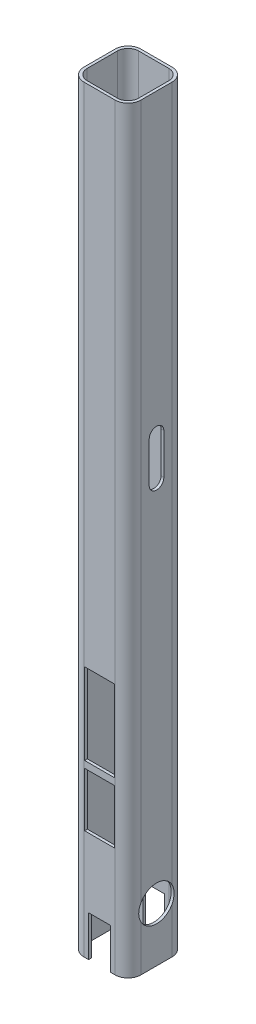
ISO-10303-21;
HEADER;
FILE_DESCRIPTION(('STEP AP214'),'2;1');
FILE_NAME('part.step','',(''),(''),'','','');
FILE_SCHEMA(('AUTOMOTIVE_DESIGN { 1 0 10303 214 1 1 1 1 }'));
ENDSEC;
DATA;
#1=APPLICATION_CONTEXT('core data for automotive mechanical design processes');
#2=APPLICATION_PROTOCOL_DEFINITION('international standard','automotive_design',2000,#1);
#3=PRODUCT_CONTEXT('',#1,'mechanical');
#4=PRODUCT('Part','Part','',(#3));
#5=PRODUCT_RELATED_PRODUCT_CATEGORY('part','',(#4));
#6=PRODUCT_DEFINITION_FORMATION('','',#4);
#7=PRODUCT_DEFINITION_CONTEXT('part definition',#1,'design');
#8=PRODUCT_DEFINITION('design','',#6,#7);
#9=PRODUCT_DEFINITION_SHAPE('','',#8);
#10=(LENGTH_UNIT() NAMED_UNIT(*) SI_UNIT(.MILLI.,.METRE.));
#11=(NAMED_UNIT(*) PLANE_ANGLE_UNIT() SI_UNIT($,.RADIAN.));
#12=(NAMED_UNIT(*) SI_UNIT($,.STERADIAN.) SOLID_ANGLE_UNIT());
#13=UNCERTAINTY_MEASURE_WITH_UNIT(LENGTH_MEASURE(1.E-05),#10,'distance_accuracy_value','');
#14=(GEOMETRIC_REPRESENTATION_CONTEXT(3) GLOBAL_UNCERTAINTY_ASSIGNED_CONTEXT((#13)) GLOBAL_UNIT_ASSIGNED_CONTEXT((#10,
#11,#12)) REPRESENTATION_CONTEXT('',''));
#15=CARTESIAN_POINT('',(0.,0.,0.));
#16=DIRECTION('',(0.,0.,1.));
#17=DIRECTION('',(1.,0.,0.));
#18=AXIS2_PLACEMENT_3D('',#15,#16,#17);
#19=CARTESIAN_POINT('',(-5.7785,0.,5.7785));
#20=DIRECTION('',(0.,-1.,0.));
#21=DIRECTION('',(0.,0.,-1.));
#22=AXIS2_PLACEMENT_3D('',#19,#20,#21);
#23=PLANE('',#22);
#24=DIRECTION('',(0.,0.,-1.));
#25=VECTOR('',#24,1.);
#26=CARTESIAN_POINT('',(-4.,0.,5.7785));
#27=LINE('',#26,#25);
#28=CARTESIAN_POINT('',(-4.,0.,10.541));
#29=VERTEX_POINT('',#28);
#30=CARTESIAN_POINT('',(-4.,0.,9.525));
#31=VERTEX_POINT('',#30);
#32=EDGE_CURVE('E561',#29,#31,#27,.T.);
#33=ORIENTED_EDGE('',*,*,#32,.F.);
#34=DIRECTION('',(1.,0.,0.));
#35=VECTOR('',#34,1.);
#36=CARTESIAN_POINT('',(-5.77849999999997,0.,10.541));
#37=LINE('',#36,#35);
#38=CARTESIAN_POINT('',(-5.77849999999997,0.,10.541));
#39=VERTEX_POINT('',#38);
#40=EDGE_CURVE('E920',#39,#29,#37,.T.);
#41=ORIENTED_EDGE('',*,*,#40,.F.);
#42=CARTESIAN_POINT('',(-5.7785,0.,5.7785));
#43=DIRECTION('',(0.,1.,0.));
#44=DIRECTION('',(0.,0.,-1.));
#45=AXIS2_PLACEMENT_3D('',#42,#43,#44);
#46=CIRCLE('',#45,4.7625);
#47=CARTESIAN_POINT('',(-10.541,0.,5.77849999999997));
#48=VERTEX_POINT('',#47);
#49=EDGE_CURVE('E902',#48,#39,#46,.T.);
#50=ORIENTED_EDGE('',*,*,#49,.F.);
#51=DIRECTION('',(0.,0.,1.));
#52=VECTOR('',#51,1.);
#53=CARTESIAN_POINT('',(-10.541,0.,5.77849999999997));
#54=LINE('',#53,#52);
#55=CARTESIAN_POINT('',(-10.541,0.,-5.77849999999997));
#56=VERTEX_POINT('',#55);
#57=EDGE_CURVE('E708',#56,#48,#54,.T.);
#58=ORIENTED_EDGE('',*,*,#57,.F.);
#59=CARTESIAN_POINT('',(-5.7785,0.,-5.7785));
#60=DIRECTION('',(0.,1.,0.));
#61=DIRECTION('',(0.,0.,-1.));
#62=AXIS2_PLACEMENT_3D('',#59,#60,#61);
#63=CIRCLE('',#62,4.7625);
#64=CARTESIAN_POINT('',(-5.77849999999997,0.,-10.541));
#65=VERTEX_POINT('',#64);
#66=EDGE_CURVE('E704',#65,#56,#63,.T.);
#67=ORIENTED_EDGE('',*,*,#66,.F.);
#68=DIRECTION('',(-1.,0.,0.));
#69=VECTOR('',#68,1.);
#70=CARTESIAN_POINT('',(-5.77849999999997,0.,-10.541));
#71=LINE('',#70,#69);
#72=CARTESIAN_POINT('',(-4.,0.,-10.541));
#73=VERTEX_POINT('',#72);
#74=EDGE_CURVE('E705',#73,#65,#71,.T.);
#75=ORIENTED_EDGE('',*,*,#74,.F.);
#76=CARTESIAN_POINT('',(-4.,0.,-9.525));
#77=VERTEX_POINT('',#76);
#78=EDGE_CURVE('E558',#77,#73,#27,.T.);
#79=ORIENTED_EDGE('',*,*,#78,.F.);
#80=DIRECTION('',(-1.,0.,0.));
#81=VECTOR('',#80,1.);
#82=CARTESIAN_POINT('',(-5.55624999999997,0.,-9.525));
#83=LINE('',#82,#81);
#84=CARTESIAN_POINT('',(-5.55624999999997,0.,-9.525));
#85=VERTEX_POINT('',#84);
#86=EDGE_CURVE('E868',#77,#85,#83,.T.);
#87=ORIENTED_EDGE('',*,*,#86,.T.);
#88=CARTESIAN_POINT('',(-5.55625,0.,-5.55625));
#89=DIRECTION('',(0.,1.,0.));
#90=DIRECTION('',(0.,0.,1.));
#91=AXIS2_PLACEMENT_3D('',#88,#89,#90);
#92=CIRCLE('',#91,3.96875);
#93=CARTESIAN_POINT('',(-9.525,0.,-5.55624999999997));
#94=VERTEX_POINT('',#93);
#95=EDGE_CURVE('E870',#85,#94,#92,.T.);
#96=ORIENTED_EDGE('',*,*,#95,.T.);
#97=DIRECTION('',(0.,0.,1.));
#98=VECTOR('',#97,1.);
#99=CARTESIAN_POINT('',(-9.525,0.,5.55624999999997));
#100=LINE('',#99,#98);
#101=CARTESIAN_POINT('',(-9.525,0.,5.55624999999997));
#102=VERTEX_POINT('',#101);
#103=EDGE_CURVE('E873',#94,#102,#100,.T.);
#104=ORIENTED_EDGE('',*,*,#103,.T.);
#105=CARTESIAN_POINT('',(-5.55625,0.,5.55625));
#106=DIRECTION('',(0.,1.,0.));
#107=DIRECTION('',(0.,0.,-1.));
#108=AXIS2_PLACEMENT_3D('',#105,#106,#107);
#109=CIRCLE('',#108,3.96875);
#110=CARTESIAN_POINT('',(-5.55624999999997,0.,9.525));
#111=VERTEX_POINT('',#110);
#112=EDGE_CURVE('E854',#102,#111,#109,.T.);
#113=ORIENTED_EDGE('',*,*,#112,.T.);
#114=DIRECTION('',(1.,0.,0.));
#115=VECTOR('',#114,1.);
#116=CARTESIAN_POINT('',(-5.55624999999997,0.,9.525));
#117=LINE('',#116,#115);
#118=EDGE_CURVE('E848',#111,#31,#117,.T.);
#119=ORIENTED_EDGE('',*,*,#118,.T.);
#120=EDGE_LOOP('',(#33,#41,#50,#58,#67,#75,#79,#87,#96,#104,#113,#119));
#121=FACE_BOUND('',#120,.T.);
#122=ADVANCED_FACE('F32',(#121),#23,.T.);
#123=CARTESIAN_POINT('',(10.541,280.,5.77849999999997));
#124=DIRECTION('',(-1.,0.,0.));
#125=DIRECTION('',(0.,0.,1.));
#126=AXIS2_PLACEMENT_3D('',#123,#124,#125);
#127=PLANE('',#126);
#128=DIRECTION('',(0.,-1.,0.));
#129=VECTOR('',#128,1.);
#130=CARTESIAN_POINT('',(10.541,170.,2.7));
#131=LINE('',#130,#129);
#132=CARTESIAN_POINT('',(10.541,170.,2.7));
#133=VERTEX_POINT('',#132);
#134=CARTESIAN_POINT('',(10.541,155.,2.7));
#135=VERTEX_POINT('',#134);
#136=EDGE_CURVE('E419',#133,#135,#131,.T.);
#137=ORIENTED_EDGE('',*,*,#136,.F.);
#138=CARTESIAN_POINT('',(10.541,170.,0.));
#139=DIRECTION('',(1.,0.,0.));
#140=DIRECTION('',(0.,0.,-1.));
#141=AXIS2_PLACEMENT_3D('',#138,#139,#140);
#142=CIRCLE('',#141,2.7);
#143=CARTESIAN_POINT('',(10.541,170.,-2.7));
#144=VERTEX_POINT('',#143);
#145=EDGE_CURVE('E48',#144,#133,#142,.T.);
#146=ORIENTED_EDGE('',*,*,#145,.F.);
#147=DIRECTION('',(0.,1.,0.));
#148=VECTOR('',#147,1.);
#149=CARTESIAN_POINT('',(10.541,170.,-2.7));
#150=LINE('',#149,#148);
#151=CARTESIAN_POINT('',(10.541,155.,-2.7));
#152=VERTEX_POINT('',#151);
#153=EDGE_CURVE('E410',#152,#144,#150,.T.);
#154=ORIENTED_EDGE('',*,*,#153,.F.);
#155=CARTESIAN_POINT('',(10.541,155.,0.));
#156=DIRECTION('',(1.,0.,0.));
#157=DIRECTION('',(0.,0.,-1.));
#158=AXIS2_PLACEMENT_3D('',#155,#156,#157);
#159=CIRCLE('',#158,2.7);
#160=EDGE_CURVE('E413',#135,#152,#159,.T.);
#161=ORIENTED_EDGE('',*,*,#160,.F.);
#162=EDGE_LOOP('',(#137,#146,#154,#161));
#163=FACE_BOUND('',#162,.T.);
#164=DIRECTION('',(0.,-1.,0.));
#165=VECTOR('',#164,1.);
#166=CARTESIAN_POINT('',(10.541,280.,5.77849999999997));
#167=LINE('',#166,#165);
#168=CARTESIAN_POINT('',(10.541,280.,5.77849999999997));
#169=VERTEX_POINT('',#168);
#170=CARTESIAN_POINT('',(10.541,23.0306043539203,5.77849999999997));
#171=VERTEX_POINT('',#170);
#172=EDGE_CURVE('E734',#169,#171,#167,.T.);
#173=ORIENTED_EDGE('',*,*,#172,.T.);
#174=CARTESIAN_POINT('',(10.541,20.,0.));
#175=DIRECTION('',(1.,0.,0.));
#176=DIRECTION('',(0.,0.,-1.));
#177=AXIS2_PLACEMENT_3D('',#174,#175,#176);
#178=CIRCLE('',#177,6.525);
#179=CARTESIAN_POINT('',(10.541,23.0306043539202,-5.7785));
#180=VERTEX_POINT('',#179);
#181=EDGE_CURVE('E569',#180,#171,#178,.T.);
#182=ORIENTED_EDGE('',*,*,#181,.F.);
#183=DIRECTION('',(0.,-1.,0.));
#184=VECTOR('',#183,1.);
#185=CARTESIAN_POINT('',(10.541,280.,-5.77849999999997));
#186=LINE('',#185,#184);
#187=CARTESIAN_POINT('',(10.541,280.,-5.77849999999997));
#188=VERTEX_POINT('',#187);
#189=EDGE_CURVE('E730',#188,#180,#186,.T.);
#190=ORIENTED_EDGE('',*,*,#189,.F.);
#191=DIRECTION('',(0.,0.,-1.));
#192=VECTOR('',#191,1.);
#193=CARTESIAN_POINT('',(10.541,280.,5.77849999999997));
#194=LINE('',#193,#192);
#195=EDGE_CURVE('E827',#169,#188,#194,.T.);
#196=ORIENTED_EDGE('',*,*,#195,.F.);
#197=EDGE_LOOP('',(#173,#182,#190,#196));
#198=FACE_BOUND('',#197,.T.);
#199=ADVANCED_FACE('F666',(#163,#198),#127,.F.);
#200=CARTESIAN_POINT('',(-10.541,280.,5.77849999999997));
#201=DIRECTION('',(1.,0.,0.));
#202=DIRECTION('',(0.,0.,-1.));
#203=AXIS2_PLACEMENT_3D('',#200,#201,#202);
#204=PLANE('',#203);
#205=DIRECTION('',(0.,1.,0.));
#206=VECTOR('',#205,1.);
#207=CARTESIAN_POINT('',(-10.541,170.,-2.7));
#208=LINE('',#207,#206);
#209=CARTESIAN_POINT('',(-10.541,155.,-2.7));
#210=VERTEX_POINT('',#209);
#211=CARTESIAN_POINT('',(-10.541,170.,-2.7));
#212=VERTEX_POINT('',#211);
#213=EDGE_CURVE('E409',#210,#212,#208,.T.);
#214=ORIENTED_EDGE('',*,*,#213,.T.);
#215=CARTESIAN_POINT('',(-10.541,170.,0.));
#216=DIRECTION('',(1.,0.,0.));
#217=DIRECTION('',(0.,0.,-1.));
#218=AXIS2_PLACEMENT_3D('',#215,#216,#217);
#219=CIRCLE('',#218,2.7);
#220=CARTESIAN_POINT('',(-10.541,170.,2.7));
#221=VERTEX_POINT('',#220);
#222=EDGE_CURVE('E392',#212,#221,#219,.T.);
#223=ORIENTED_EDGE('',*,*,#222,.T.);
#224=DIRECTION('',(0.,-1.,0.));
#225=VECTOR('',#224,1.);
#226=CARTESIAN_POINT('',(-10.541,170.,2.7));
#227=LINE('',#226,#225);
#228=CARTESIAN_POINT('',(-10.541,155.,2.7));
#229=VERTEX_POINT('',#228);
#230=EDGE_CURVE('E401',#221,#229,#227,.T.);
#231=ORIENTED_EDGE('',*,*,#230,.T.);
#232=CARTESIAN_POINT('',(-10.541,155.,0.));
#233=DIRECTION('',(1.,0.,0.));
#234=DIRECTION('',(0.,0.,-1.));
#235=AXIS2_PLACEMENT_3D('',#232,#233,#234);
#236=CIRCLE('',#235,2.7);
#237=EDGE_CURVE('E56',#229,#210,#236,.T.);
#238=ORIENTED_EDGE('',*,*,#237,.T.);
#239=EDGE_LOOP('',(#214,#223,#231,#238));
#240=FACE_BOUND('',#239,.T.);
#241=DIRECTION('',(0.,-1.,0.));
#242=VECTOR('',#241,1.);
#243=CARTESIAN_POINT('',(-10.541,280.,-5.77849999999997));
#244=LINE('',#243,#242);
#245=CARTESIAN_POINT('',(-10.541,280.,-5.77849999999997));
#246=VERTEX_POINT('',#245);
#247=CARTESIAN_POINT('',(-10.541,23.0306043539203,-5.77849999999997));
#248=VERTEX_POINT('',#247);
#249=EDGE_CURVE('E722',#246,#248,#244,.T.);
#250=ORIENTED_EDGE('',*,*,#249,.T.);
#251=CARTESIAN_POINT('',(-10.541,20.,0.));
#252=DIRECTION('',(1.,0.,0.));
#253=DIRECTION('',(0.,0.,-1.));
#254=AXIS2_PLACEMENT_3D('',#251,#252,#253);
#255=CIRCLE('',#254,6.525);
#256=CARTESIAN_POINT('',(-10.541,23.0306043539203,5.77849999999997));
#257=VERTEX_POINT('',#256);
#258=EDGE_CURVE('E564',#248,#257,#255,.T.);
#259=ORIENTED_EDGE('',*,*,#258,.T.);
#260=DIRECTION('',(0.,-1.,0.));
#261=VECTOR('',#260,1.);
#262=CARTESIAN_POINT('',(-10.541,280.,5.77849999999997));
#263=LINE('',#262,#261);
#264=CARTESIAN_POINT('',(-10.541,280.,5.77849999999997));
#265=VERTEX_POINT('',#264);
#266=EDGE_CURVE('E717',#265,#257,#263,.T.);
#267=ORIENTED_EDGE('',*,*,#266,.F.);
#268=DIRECTION('',(0.,0.,1.));
#269=VECTOR('',#268,1.);
#270=CARTESIAN_POINT('',(-10.541,280.,5.77849999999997));
#271=LINE('',#270,#269);
#272=EDGE_CURVE('E915',#246,#265,#271,.T.);
#273=ORIENTED_EDGE('',*,*,#272,.F.);
#274=EDGE_LOOP('',(#250,#259,#267,#273));
#275=FACE_BOUND('',#274,.T.);
#276=ADVANCED_FACE('F406',(#240,#275),#204,.F.);
#277=CARTESIAN_POINT('',(9.525,280.,5.55624999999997));
#278=DIRECTION('',(-1.,0.,0.));
#279=DIRECTION('',(0.,0.,1.));
#280=AXIS2_PLACEMENT_3D('',#277,#278,#279);
#281=PLANE('',#280);
#282=CARTESIAN_POINT('',(9.525,170.,0.));
#283=DIRECTION('',(-1.,0.,0.));
#284=DIRECTION('',(0.,0.,1.));
#285=AXIS2_PLACEMENT_3D('',#282,#283,#284);
#286=CIRCLE('',#285,2.7);
#287=CARTESIAN_POINT('',(9.525,170.,2.7));
#288=VERTEX_POINT('',#287);
#289=CARTESIAN_POINT('',(9.525,170.,-2.7));
#290=VERTEX_POINT('',#289);
#291=EDGE_CURVE('E439',#288,#290,#286,.T.);
#292=ORIENTED_EDGE('',*,*,#291,.F.);
#293=DIRECTION('',(0.,1.,0.));
#294=VECTOR('',#293,1.);
#295=CARTESIAN_POINT('',(9.525,280.,2.70000000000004));
#296=LINE('',#295,#294);
#297=CARTESIAN_POINT('',(9.525,155.,2.7));
#298=VERTEX_POINT('',#297);
#299=EDGE_CURVE('E426',#298,#288,#296,.T.);
#300=ORIENTED_EDGE('',*,*,#299,.F.);
#301=CARTESIAN_POINT('',(9.525,155.,0.));
#302=DIRECTION('',(-1.,0.,0.));
#303=DIRECTION('',(0.,0.,1.));
#304=AXIS2_PLACEMENT_3D('',#301,#302,#303);
#305=CIRCLE('',#304,2.7);
#306=CARTESIAN_POINT('',(9.525,155.,-2.7));
#307=VERTEX_POINT('',#306);
#308=EDGE_CURVE('E434',#307,#298,#305,.T.);
#309=ORIENTED_EDGE('',*,*,#308,.F.);
#310=DIRECTION('',(0.,-1.,0.));
#311=VECTOR('',#310,1.);
#312=CARTESIAN_POINT('',(9.525,280.,-2.69999999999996));
#313=LINE('',#312,#311);
#314=EDGE_CURVE('E437',#290,#307,#313,.T.);
#315=ORIENTED_EDGE('',*,*,#314,.F.);
#316=EDGE_LOOP('',(#292,#300,#309,#315));
#317=FACE_BOUND('',#316,.T.);
#318=CARTESIAN_POINT('',(9.525,20.,0.));
#319=DIRECTION('',(-1.,0.,0.));
#320=DIRECTION('',(0.,0.,1.));
#321=AXIS2_PLACEMENT_3D('',#318,#319,#320);
#322=CIRCLE('',#321,6.525);
#323=CARTESIAN_POINT('',(9.525,23.4210686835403,5.55624999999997));
#324=VERTEX_POINT('',#323);
#325=CARTESIAN_POINT('',(9.525,23.4210686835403,-5.55624999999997));
#326=VERTEX_POINT('',#325);
#327=EDGE_CURVE('E988',#324,#326,#322,.T.);
#328=ORIENTED_EDGE('',*,*,#327,.F.);
#329=DIRECTION('',(0.,-1.,0.));
#330=VECTOR('',#329,1.);
#331=CARTESIAN_POINT('',(9.525,280.,5.55624999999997));
#332=LINE('',#331,#330);
#333=CARTESIAN_POINT('',(9.525,280.,5.55624999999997));
#334=VERTEX_POINT('',#333);
#335=EDGE_CURVE('E894',#334,#324,#332,.T.);
#336=ORIENTED_EDGE('',*,*,#335,.F.);
#337=DIRECTION('',(0.,0.,-1.));
#338=VECTOR('',#337,1.);
#339=CARTESIAN_POINT('',(9.525,280.,5.55624999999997));
#340=LINE('',#339,#338);
#341=CARTESIAN_POINT('',(9.525,280.,-5.55624999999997));
#342=VERTEX_POINT('',#341);
#343=EDGE_CURVE('E1012',#334,#342,#340,.T.);
#344=ORIENTED_EDGE('',*,*,#343,.T.);
#345=DIRECTION('',(0.,-1.,0.));
#346=VECTOR('',#345,1.);
#347=CARTESIAN_POINT('',(9.525,280.,-5.55624999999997));
#348=LINE('',#347,#346);
#349=EDGE_CURVE('E890',#342,#326,#348,.T.);
#350=ORIENTED_EDGE('',*,*,#349,.T.);
#351=EDGE_LOOP('',(#328,#336,#344,#350));
#352=FACE_BOUND('',#351,.T.);
#353=ADVANCED_FACE('F816',(#317,#352),#281,.T.);
#354=CARTESIAN_POINT('',(-9.525,280.,5.55624999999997));
#355=DIRECTION('',(1.,0.,0.));
#356=DIRECTION('',(0.,0.,-1.));
#357=AXIS2_PLACEMENT_3D('',#354,#355,#356);
#358=PLANE('',#357);
#359=CARTESIAN_POINT('',(-9.525,170.,0.));
#360=DIRECTION('',(1.,0.,0.));
#361=DIRECTION('',(0.,0.,-1.));
#362=AXIS2_PLACEMENT_3D('',#359,#360,#361);
#363=CIRCLE('',#362,2.7);
#364=CARTESIAN_POINT('',(-9.525,170.,-2.7));
#365=VERTEX_POINT('',#364);
#366=CARTESIAN_POINT('',(-9.525,170.,2.7));
#367=VERTEX_POINT('',#366);
#368=EDGE_CURVE('E11',#365,#367,#363,.T.);
#369=ORIENTED_EDGE('',*,*,#368,.F.);
#370=DIRECTION('',(0.,1.,0.));
#371=VECTOR('',#370,1.);
#372=CARTESIAN_POINT('',(-9.525,280.,-2.69999999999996));
#373=LINE('',#372,#371);
#374=CARTESIAN_POINT('',(-9.525,155.,-2.7));
#375=VERTEX_POINT('',#374);
#376=EDGE_CURVE('E41',#375,#365,#373,.T.);
#377=ORIENTED_EDGE('',*,*,#376,.F.);
#378=CARTESIAN_POINT('',(-9.525,155.,0.));
#379=DIRECTION('',(1.,0.,0.));
#380=DIRECTION('',(0.,0.,-1.));
#381=AXIS2_PLACEMENT_3D('',#378,#379,#380);
#382=CIRCLE('',#381,2.7);
#383=CARTESIAN_POINT('',(-9.525,155.,2.7));
#384=VERTEX_POINT('',#383);
#385=EDGE_CURVE('E781',#384,#375,#382,.T.);
#386=ORIENTED_EDGE('',*,*,#385,.F.);
#387=DIRECTION('',(0.,-1.,0.));
#388=VECTOR('',#387,1.);
#389=CARTESIAN_POINT('',(-9.525,280.,2.70000000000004));
#390=LINE('',#389,#388);
#391=EDGE_CURVE('E779',#367,#384,#390,.T.);
#392=ORIENTED_EDGE('',*,*,#391,.F.);
#393=EDGE_LOOP('',(#369,#377,#386,#392));
#394=FACE_BOUND('',#393,.T.);
#395=CARTESIAN_POINT('',(-9.525,20.,0.));
#396=DIRECTION('',(1.,0.,0.));
#397=DIRECTION('',(0.,0.,-1.));
#398=AXIS2_PLACEMENT_3D('',#395,#396,#397);
#399=CIRCLE('',#398,6.525);
#400=CARTESIAN_POINT('',(-9.525,23.4210686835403,-5.55624999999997));
#401=VERTEX_POINT('',#400);
#402=CARTESIAN_POINT('',(-9.525,23.4210686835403,5.55624999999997));
#403=VERTEX_POINT('',#402);
#404=EDGE_CURVE('E745',#401,#403,#399,.T.);
#405=ORIENTED_EDGE('',*,*,#404,.F.);
#406=DIRECTION('',(0.,-1.,0.));
#407=VECTOR('',#406,1.);
#408=CARTESIAN_POINT('',(-9.525,280.,-5.55624999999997));
#409=LINE('',#408,#407);
#410=CARTESIAN_POINT('',(-9.525,280.,-5.55624999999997));
#411=VERTEX_POINT('',#410);
#412=EDGE_CURVE('E881',#411,#401,#409,.T.);
#413=ORIENTED_EDGE('',*,*,#412,.F.);
#414=DIRECTION('',(0.,0.,1.));
#415=VECTOR('',#414,1.);
#416=CARTESIAN_POINT('',(-9.525,280.,5.55624999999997));
#417=LINE('',#416,#415);
#418=CARTESIAN_POINT('',(-9.525,280.,5.55624999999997));
#419=VERTEX_POINT('',#418);
#420=EDGE_CURVE('E1003',#411,#419,#417,.T.);
#421=ORIENTED_EDGE('',*,*,#420,.T.);
#422=DIRECTION('',(0.,-1.,0.));
#423=VECTOR('',#422,1.);
#424=CARTESIAN_POINT('',(-9.525,280.,5.55624999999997));
#425=LINE('',#424,#423);
#426=EDGE_CURVE('E876',#419,#403,#425,.T.);
#427=ORIENTED_EDGE('',*,*,#426,.T.);
#428=EDGE_LOOP('',(#405,#413,#421,#427));
#429=FACE_BOUND('',#428,.T.);
#430=ADVANCED_FACE('F682',(#394,#429),#358,.T.);
#431=CARTESIAN_POINT('',(-5.7785,280.,5.7785));
#432=DIRECTION('',(0.,-1.,0.));
#433=DIRECTION('',(0.,0.,-1.));
#434=AXIS2_PLACEMENT_3D('',#431,#432,#433);
#435=PLANE('',#434);
#436=CARTESIAN_POINT('',(-5.7785,280.,5.7785));
#437=DIRECTION('',(0.,1.,0.));
#438=DIRECTION('',(0.,0.,-1.));
#439=AXIS2_PLACEMENT_3D('',#436,#437,#438);
#440=CIRCLE('',#439,4.7625);
#441=CARTESIAN_POINT('',(-5.77849999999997,280.,10.541));
#442=VERTEX_POINT('',#441);
#443=EDGE_CURVE('E716',#265,#442,#440,.T.);
#444=ORIENTED_EDGE('',*,*,#443,.T.);
#445=DIRECTION('',(1.,0.,0.));
#446=VECTOR('',#445,1.);
#447=CARTESIAN_POINT('',(-5.77849999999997,280.,10.541));
#448=LINE('',#447,#446);
#449=CARTESIAN_POINT('',(5.77849999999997,280.,10.541));
#450=VERTEX_POINT('',#449);
#451=EDGE_CURVE('E905',#442,#450,#448,.T.);
#452=ORIENTED_EDGE('',*,*,#451,.T.);
#453=CARTESIAN_POINT('',(5.7785,280.,5.7785));
#454=DIRECTION('',(0.,1.,0.));
#455=DIRECTION('',(0.,0.,1.));
#456=AXIS2_PLACEMENT_3D('',#453,#454,#455);
#457=CIRCLE('',#456,4.7625);
#458=EDGE_CURVE('E830',#450,#169,#457,.T.);
#459=ORIENTED_EDGE('',*,*,#458,.T.);
#460=ORIENTED_EDGE('',*,*,#195,.T.);
#461=CARTESIAN_POINT('',(5.7785,280.,-5.7785));
#462=DIRECTION('',(0.,1.,0.));
#463=DIRECTION('',(0.,0.,-1.));
#464=AXIS2_PLACEMENT_3D('',#461,#462,#463);
#465=CIRCLE('',#464,4.7625);
#466=CARTESIAN_POINT('',(5.77849999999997,280.,-10.541));
#467=VERTEX_POINT('',#466);
#468=EDGE_CURVE('E909',#188,#467,#465,.T.);
#469=ORIENTED_EDGE('',*,*,#468,.T.);
#470=DIRECTION('',(-1.,0.,0.));
#471=VECTOR('',#470,1.);
#472=CARTESIAN_POINT('',(-5.77849999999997,280.,-10.541));
#473=LINE('',#472,#471);
#474=CARTESIAN_POINT('',(-5.77849999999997,280.,-10.541));
#475=VERTEX_POINT('',#474);
#476=EDGE_CURVE('E911',#467,#475,#473,.T.);
#477=ORIENTED_EDGE('',*,*,#476,.T.);
#478=CARTESIAN_POINT('',(-5.7785,280.,-5.7785));
#479=DIRECTION('',(0.,1.,0.));
#480=DIRECTION('',(0.,0.,-1.));
#481=AXIS2_PLACEMENT_3D('',#478,#479,#480);
#482=CIRCLE('',#481,4.7625);
#483=EDGE_CURVE('E913',#475,#246,#482,.T.);
#484=ORIENTED_EDGE('',*,*,#483,.T.);
#485=ORIENTED_EDGE('',*,*,#272,.T.);
#486=EDGE_LOOP('',(#444,#452,#459,#460,#469,#477,#484,#485));
#487=FACE_BOUND('',#486,.T.);
#488=CARTESIAN_POINT('',(-5.55625,280.,5.55625));
#489=DIRECTION('',(0.,1.,0.));
#490=DIRECTION('',(0.,0.,-1.));
#491=AXIS2_PLACEMENT_3D('',#488,#489,#490);
#492=CIRCLE('',#491,3.96875);
#493=CARTESIAN_POINT('',(-5.55624999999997,280.,9.525));
#494=VERTEX_POINT('',#493);
#495=EDGE_CURVE('E875',#419,#494,#492,.T.);
#496=ORIENTED_EDGE('',*,*,#495,.F.);
#497=ORIENTED_EDGE('',*,*,#420,.F.);
#498=CARTESIAN_POINT('',(-5.55625,280.,-5.55625));
#499=DIRECTION('',(0.,1.,0.));
#500=DIRECTION('',(0.,0.,1.));
#501=AXIS2_PLACEMENT_3D('',#498,#499,#500);
#502=CIRCLE('',#501,3.96875);
#503=CARTESIAN_POINT('',(-5.55624999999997,280.,-9.525));
#504=VERTEX_POINT('',#503);
#505=EDGE_CURVE('E1004',#504,#411,#502,.T.);
#506=ORIENTED_EDGE('',*,*,#505,.F.);
#507=DIRECTION('',(-1.,0.,0.));
#508=VECTOR('',#507,1.);
#509=CARTESIAN_POINT('',(-5.55624999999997,280.,-9.525));
#510=LINE('',#509,#508);
#511=CARTESIAN_POINT('',(5.55624999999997,280.,-9.525));
#512=VERTEX_POINT('',#511);
#513=EDGE_CURVE('E1007',#512,#504,#510,.T.);
#514=ORIENTED_EDGE('',*,*,#513,.F.);
#515=CARTESIAN_POINT('',(5.55625,280.,-5.55625));
#516=DIRECTION('',(0.,1.,0.));
#517=DIRECTION('',(0.,0.,-1.));
#518=AXIS2_PLACEMENT_3D('',#515,#516,#517);
#519=CIRCLE('',#518,3.96875);
#520=EDGE_CURVE('E960',#342,#512,#519,.T.);
#521=ORIENTED_EDGE('',*,*,#520,.F.);
#522=ORIENTED_EDGE('',*,*,#343,.F.);
#523=CARTESIAN_POINT('',(5.55625,280.,5.55625));
#524=DIRECTION('',(0.,1.,0.));
#525=DIRECTION('',(0.,0.,-1.));
#526=AXIS2_PLACEMENT_3D('',#523,#524,#525);
#527=CIRCLE('',#526,3.96875);
#528=CARTESIAN_POINT('',(5.55624999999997,280.,9.525));
#529=VERTEX_POINT('',#528);
#530=EDGE_CURVE('E1014',#529,#334,#527,.T.);
#531=ORIENTED_EDGE('',*,*,#530,.F.);
#532=DIRECTION('',(1.,0.,0.));
#533=VECTOR('',#532,1.);
#534=CARTESIAN_POINT('',(-5.55624999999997,280.,9.525));
#535=LINE('',#534,#533);
#536=EDGE_CURVE('E941',#494,#529,#535,.T.);
#537=ORIENTED_EDGE('',*,*,#536,.F.);
#538=EDGE_LOOP('',(#496,#497,#506,#514,#521,#522,#531,#537));
#539=FACE_BOUND('',#538,.T.);
#540=ADVANCED_FACE('F677',(#487,#539),#435,.F.);
#541=DIRECTION('',(0.,0.,1.));
#542=VECTOR('',#541,1.);
#543=CARTESIAN_POINT('',(4.,0.,5.7785));
#544=LINE('',#543,#542);
#545=CARTESIAN_POINT('',(4.,0.,-10.541));
#546=VERTEX_POINT('',#545);
#547=CARTESIAN_POINT('',(4.,0.,-9.525));
#548=VERTEX_POINT('',#547);
#549=EDGE_CURVE('E553',#546,#548,#544,.T.);
#550=ORIENTED_EDGE('',*,*,#549,.F.);
#551=CARTESIAN_POINT('',(5.77849999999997,0.,-10.541));
#552=VERTEX_POINT('',#551);
#553=EDGE_CURVE('E689',#552,#546,#71,.T.);
#554=ORIENTED_EDGE('',*,*,#553,.F.);
#555=CARTESIAN_POINT('',(5.7785,0.,-5.7785));
#556=DIRECTION('',(0.,1.,0.));
#557=DIRECTION('',(0.,0.,-1.));
#558=AXIS2_PLACEMENT_3D('',#555,#556,#557);
#559=CIRCLE('',#558,4.7625);
#560=CARTESIAN_POINT('',(10.541,0.,-5.77849999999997));
#561=VERTEX_POINT('',#560);
#562=EDGE_CURVE('E710',#561,#552,#559,.T.);
#563=ORIENTED_EDGE('',*,*,#562,.F.);
#564=DIRECTION('',(0.,0.,-1.));
#565=VECTOR('',#564,1.);
#566=CARTESIAN_POINT('',(10.541,0.,5.77849999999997));
#567=LINE('',#566,#565);
#568=CARTESIAN_POINT('',(10.541,0.,5.77849999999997));
#569=VERTEX_POINT('',#568);
#570=EDGE_CURVE('E923',#569,#561,#567,.T.);
#571=ORIENTED_EDGE('',*,*,#570,.F.);
#572=CARTESIAN_POINT('',(5.7785,0.,5.7785));
#573=DIRECTION('',(0.,1.,0.));
#574=DIRECTION('',(0.,0.,1.));
#575=AXIS2_PLACEMENT_3D('',#572,#573,#574);
#576=CIRCLE('',#575,4.7625);
#577=CARTESIAN_POINT('',(5.77849999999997,0.,10.541));
#578=VERTEX_POINT('',#577);
#579=EDGE_CURVE('E922',#578,#569,#576,.T.);
#580=ORIENTED_EDGE('',*,*,#579,.F.);
#581=CARTESIAN_POINT('',(4.,0.,10.541));
#582=VERTEX_POINT('',#581);
#583=EDGE_CURVE('E919',#582,#578,#37,.T.);
#584=ORIENTED_EDGE('',*,*,#583,.F.);
#585=CARTESIAN_POINT('',(4.,0.,9.525));
#586=VERTEX_POINT('',#585);
#587=EDGE_CURVE('E556',#586,#582,#544,.T.);
#588=ORIENTED_EDGE('',*,*,#587,.F.);
#589=CARTESIAN_POINT('',(5.55624999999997,0.,9.525));
#590=VERTEX_POINT('',#589);
#591=EDGE_CURVE('E856',#586,#590,#117,.T.);
#592=ORIENTED_EDGE('',*,*,#591,.T.);
#593=CARTESIAN_POINT('',(5.55625,0.,5.55625));
#594=DIRECTION('',(0.,1.,0.));
#595=DIRECTION('',(0.,0.,-1.));
#596=AXIS2_PLACEMENT_3D('',#593,#594,#595);
#597=CIRCLE('',#596,3.96875);
#598=CARTESIAN_POINT('',(9.525,0.,5.55624999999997));
#599=VERTEX_POINT('',#598);
#600=EDGE_CURVE('E855',#590,#599,#597,.T.);
#601=ORIENTED_EDGE('',*,*,#600,.T.);
#602=DIRECTION('',(0.,0.,-1.));
#603=VECTOR('',#602,1.);
#604=CARTESIAN_POINT('',(9.525,0.,5.55624999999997));
#605=LINE('',#604,#603);
#606=CARTESIAN_POINT('',(9.525,0.,-5.55624999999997));
#607=VERTEX_POINT('',#606);
#608=EDGE_CURVE('E859',#599,#607,#605,.T.);
#609=ORIENTED_EDGE('',*,*,#608,.T.);
#610=CARTESIAN_POINT('',(5.55625,0.,-5.55625));
#611=DIRECTION('',(0.,1.,0.));
#612=DIRECTION('',(0.,0.,-1.));
#613=AXIS2_PLACEMENT_3D('',#610,#611,#612);
#614=CIRCLE('',#613,3.96875);
#615=CARTESIAN_POINT('',(5.55624999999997,0.,-9.525));
#616=VERTEX_POINT('',#615);
#617=EDGE_CURVE('E866',#607,#616,#614,.T.);
#618=ORIENTED_EDGE('',*,*,#617,.T.);
#619=EDGE_CURVE('E692',#616,#548,#83,.T.);
#620=ORIENTED_EDGE('',*,*,#619,.T.);
#621=EDGE_LOOP('',(#550,#554,#563,#571,#580,#584,#588,#592,#601,#609,#618,#620));
#622=FACE_BOUND('',#621,.T.);
#623=ADVANCED_FACE('F661',(#622),#23,.T.);
#624=CARTESIAN_POINT('',(-5.7785,280.,5.7785));
#625=DIRECTION('',(0.,-1.,0.));
#626=DIRECTION('',(0.,0.,-1.));
#627=AXIS2_PLACEMENT_3D('',#624,#625,#626);
#628=CYLINDRICAL_SURFACE('',#627,4.7625);
#629=ORIENTED_EDGE('',*,*,#266,.T.);
#630=CARTESIAN_POINT('',(-10.541,23.0306043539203,5.77849999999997));
#631=CARTESIAN_POINT('',(-10.540996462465,22.9405095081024,5.82575140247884));
#632=CARTESIAN_POINT('',(-10.5402973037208,22.8493264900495,5.8708862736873));
#633=CARTESIAN_POINT('',(-10.5378546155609,22.6649695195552,5.95683707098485));
#634=CARTESIAN_POINT('',(-10.5361111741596,22.5717957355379,5.99765336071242));
#635=CARTESIAN_POINT('',(-10.5298354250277,22.2895881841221,6.11348852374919));
#636=CARTESIAN_POINT('',(-10.5242573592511,22.0978250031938,6.1819163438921));
#637=CARTESIAN_POINT('',(-10.5126891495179,21.7092591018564,6.30041559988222));
#638=CARTESIAN_POINT('',(-10.5067000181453,21.5124694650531,6.35053034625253));
#639=CARTESIAN_POINT('',(-10.4961016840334,21.1150549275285,6.43221644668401));
#640=CARTESIAN_POINT('',(-10.491492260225,20.9144306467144,6.46379077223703));
#641=CARTESIAN_POINT('',(-10.4851588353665,20.530908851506,6.50593893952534));
#642=CARTESIAN_POINT('',(-10.4831958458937,20.3482062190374,6.51827122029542));
#643=CARTESIAN_POINT('',(-10.4817298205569,19.9824029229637,6.52754027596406));
#644=CARTESIAN_POINT('',(-10.4822266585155,19.7993022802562,6.52447784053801));
#645=CARTESIAN_POINT('',(-10.4855835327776,19.4341640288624,6.50299029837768));
#646=CARTESIAN_POINT('',(-10.4884418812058,19.2521257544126,6.48457616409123));
#647=CARTESIAN_POINT('',(-10.495949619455,18.8902886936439,6.43253945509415));
#648=CARTESIAN_POINT('',(-10.5005987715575,18.7104896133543,6.39891889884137));
#649=CARTESIAN_POINT('',(-10.509471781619,18.3967141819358,6.32649305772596));
#650=CARTESIAN_POINT('',(-10.5135342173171,18.2620009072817,6.29081779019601));
#651=CARTESIAN_POINT('',(-10.521497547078,17.9951488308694,6.21092496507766));
#652=CARTESIAN_POINT('',(-10.5253984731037,17.8630095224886,6.16670910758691));
#653=CARTESIAN_POINT('',(-10.5323249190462,17.6018288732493,6.06990844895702));
#654=CARTESIAN_POINT('',(-10.535350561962,17.4727870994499,6.01732482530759));
#655=CARTESIAN_POINT('',(-10.5396798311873,17.2182726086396,5.90398605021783));
#656=CARTESIAN_POINT('',(-10.5409829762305,17.0928008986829,5.84322862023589));
#657=CARTESIAN_POINT('',(-10.541,16.9693956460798,5.77849999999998));
#658=B_SPLINE_CURVE_WITH_KNOTS('',3,(#630,#631,#632,#633,#634,#635,#636,#637,#638,#639,#640,
#641,#642,#643,#644,#645,#646,#647,#648,#649,#650,#651,#652,#653,#654,#655,#656,#657),
.UNSPECIFIED.,.F.,.F.,(4,2,2,2,2,2,2,2,2,2,2,2,2,4),(0.,0.305135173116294,0.610244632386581,
1.22031776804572,1.82893859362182,2.43746184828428,2.98620055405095,3.53491111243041,
4.08322982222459,4.63147577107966,5.04945539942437,5.46735190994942,5.88518966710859,
6.303144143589),.UNSPECIFIED.);
#659=CARTESIAN_POINT('',(-10.541,16.9693956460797,5.77849999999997));
#660=VERTEX_POINT('',#659);
#661=EDGE_CURVE('E643',#257,#660,#658,.T.);
#662=ORIENTED_EDGE('',*,*,#661,.T.);
#663=EDGE_CURVE('E721',#660,#48,#263,.T.);
#664=ORIENTED_EDGE('',*,*,#663,.T.);
#665=ORIENTED_EDGE('',*,*,#49,.T.);
#666=DIRECTION('',(0.,-1.,0.));
#667=VECTOR('',#666,1.);
#668=CARTESIAN_POINT('',(-5.77849999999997,280.,10.541));
#669=LINE('',#668,#667);
#670=EDGE_CURVE('E740',#442,#39,#669,.T.);
#671=ORIENTED_EDGE('',*,*,#670,.F.);
#672=ORIENTED_EDGE('',*,*,#443,.F.);
#673=EDGE_LOOP('',(#629,#662,#664,#665,#671,#672));
#674=FACE_BOUND('',#673,.T.);
#675=ADVANCED_FACE('F34',(#674),#628,.T.);
#676=CARTESIAN_POINT('',(-5.77849999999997,280.,10.541));
#677=DIRECTION('',(0.,0.,-1.));
#678=DIRECTION('',(-1.,0.,0.));
#679=AXIS2_PLACEMENT_3D('',#676,#677,#678);
#680=PLANE('',#679);
#681=DIRECTION('',(-1.,0.,0.));
#682=VECTOR('',#681,1.);
#683=CARTESIAN_POINT('',(-5.5,93.,10.541));
#684=LINE('',#683,#682);
#685=CARTESIAN_POINT('',(5.5,93.,10.541));
#686=VERTEX_POINT('',#685);
#687=CARTESIAN_POINT('',(-5.5,93.,10.541));
#688=VERTEX_POINT('',#687);
#689=EDGE_CURVE('E443',#686,#688,#684,.T.);
#690=ORIENTED_EDGE('',*,*,#689,.F.);
#691=DIRECTION('',(0.,1.,0.));
#692=VECTOR('',#691,1.);
#693=CARTESIAN_POINT('',(5.5,63.,10.541));
#694=LINE('',#693,#692);
#695=CARTESIAN_POINT('',(5.5,63.,10.541));
#696=VERTEX_POINT('',#695);
#697=EDGE_CURVE('E441',#696,#686,#694,.T.);
#698=ORIENTED_EDGE('',*,*,#697,.F.);
#699=DIRECTION('',(1.,0.,0.));
#700=VECTOR('',#699,1.);
#701=CARTESIAN_POINT('',(-5.5,63.,10.541));
#702=LINE('',#701,#700);
#703=CARTESIAN_POINT('',(-5.5,63.,10.541));
#704=VERTEX_POINT('',#703);
#705=EDGE_CURVE('E449',#704,#696,#702,.T.);
#706=ORIENTED_EDGE('',*,*,#705,.F.);
#707=DIRECTION('',(0.,-1.,0.));
#708=VECTOR('',#707,1.);
#709=CARTESIAN_POINT('',(-5.5,63.,10.541));
#710=LINE('',#709,#708);
#711=EDGE_CURVE('E446',#688,#704,#710,.T.);
#712=ORIENTED_EDGE('',*,*,#711,.F.);
#713=EDGE_LOOP('',(#690,#698,#706,#712));
#714=FACE_BOUND('',#713,.T.);
#715=ORIENTED_EDGE('',*,*,#40,.T.);
#716=DIRECTION('',(0.,1.,0.));
#717=VECTOR('',#716,1.);
#718=CARTESIAN_POINT('',(-4.,-15.,10.541));
#719=LINE('',#718,#717);
#720=CARTESIAN_POINT('',(-4.,15.,10.541));
#721=VERTEX_POINT('',#720);
#722=EDGE_CURVE('E482',#29,#721,#719,.T.);
#723=ORIENTED_EDGE('',*,*,#722,.T.);
#724=DIRECTION('',(1.,0.,0.));
#725=VECTOR('',#724,1.);
#726=CARTESIAN_POINT('',(4.,15.,10.541));
#727=LINE('',#726,#725);
#728=CARTESIAN_POINT('',(4.,15.,10.541));
#729=VERTEX_POINT('',#728);
#730=EDGE_CURVE('E485',#721,#729,#727,.T.);
#731=ORIENTED_EDGE('',*,*,#730,.T.);
#732=DIRECTION('',(0.,-1.,0.));
#733=VECTOR('',#732,1.);
#734=CARTESIAN_POINT('',(4.,-15.,10.541));
#735=LINE('',#734,#733);
#736=EDGE_CURVE('E489',#729,#582,#735,.T.);
#737=ORIENTED_EDGE('',*,*,#736,.T.);
#738=ORIENTED_EDGE('',*,*,#583,.T.);
#739=DIRECTION('',(0.,-1.,0.));
#740=VECTOR('',#739,1.);
#741=CARTESIAN_POINT('',(5.77849999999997,280.,10.541));
#742=LINE('',#741,#740);
#743=EDGE_CURVE('E737',#450,#578,#742,.T.);
#744=ORIENTED_EDGE('',*,*,#743,.F.);
#745=ORIENTED_EDGE('',*,*,#451,.F.);
#746=ORIENTED_EDGE('',*,*,#670,.T.);
#747=EDGE_LOOP('',(#715,#723,#731,#737,#738,#744,#745,#746));
#748=FACE_BOUND('',#747,.T.);
#749=DIRECTION('',(-1.,0.,0.));
#750=VECTOR('',#749,1.);
#751=CARTESIAN_POINT('',(-5.5,40.5,10.541));
#752=LINE('',#751,#750);
#753=CARTESIAN_POINT('',(5.5,40.5,10.541));
#754=VERTEX_POINT('',#753);
#755=CARTESIAN_POINT('',(-5.5,40.5,10.541));
#756=VERTEX_POINT('',#755);
#757=EDGE_CURVE('E517',#754,#756,#752,.T.);
#758=ORIENTED_EDGE('',*,*,#757,.T.);
#759=DIRECTION('',(0.,1.,0.));
#760=VECTOR('',#759,1.);
#761=CARTESIAN_POINT('',(-5.5,60.5,10.541));
#762=LINE('',#761,#760);
#763=CARTESIAN_POINT('',(-5.5,60.5,10.541));
#764=VERTEX_POINT('',#763);
#765=EDGE_CURVE('E507',#756,#764,#762,.T.);
#766=ORIENTED_EDGE('',*,*,#765,.T.);
#767=DIRECTION('',(1.,0.,0.));
#768=VECTOR('',#767,1.);
#769=CARTESIAN_POINT('',(5.5,60.5,10.541));
#770=LINE('',#769,#768);
#771=CARTESIAN_POINT('',(5.5,60.5,10.541));
#772=VERTEX_POINT('',#771);
#773=EDGE_CURVE('E510',#764,#772,#770,.T.);
#774=ORIENTED_EDGE('',*,*,#773,.T.);
#775=DIRECTION('',(0.,-1.,0.));
#776=VECTOR('',#775,1.);
#777=CARTESIAN_POINT('',(5.5,60.5,10.541));
#778=LINE('',#777,#776);
#779=EDGE_CURVE('E514',#772,#754,#778,.T.);
#780=ORIENTED_EDGE('',*,*,#779,.T.);
#781=EDGE_LOOP('',(#758,#766,#774,#780));
#782=FACE_BOUND('',#781,.T.);
#783=ADVANCED_FACE('F654',(#714,#748,#782),#680,.F.);
#784=CARTESIAN_POINT('',(5.7785,280.,5.7785));
#785=DIRECTION('',(0.,-1.,0.));
#786=DIRECTION('',(0.,0.,-1.));
#787=AXIS2_PLACEMENT_3D('',#784,#785,#786);
#788=CYLINDRICAL_SURFACE('',#787,4.7625);
#789=CARTESIAN_POINT('',(10.541,16.9693956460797,5.77849999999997));
#790=VERTEX_POINT('',#789);
#791=EDGE_CURVE('E733',#790,#569,#167,.T.);
#792=ORIENTED_EDGE('',*,*,#791,.F.);
#793=CARTESIAN_POINT('',(10.541,16.9693956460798,5.77849999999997));
#794=CARTESIAN_POINT('',(10.540996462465,17.0594904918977,5.82575140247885));
#795=CARTESIAN_POINT('',(10.5402973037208,17.1506735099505,5.87088627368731));
#796=CARTESIAN_POINT('',(10.5378546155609,17.3350304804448,5.95683707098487));
#797=CARTESIAN_POINT('',(10.5361111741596,17.4282042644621,5.99765336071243));
#798=CARTESIAN_POINT('',(10.5298354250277,17.7104118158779,6.11348852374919));
#799=CARTESIAN_POINT('',(10.5242573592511,17.9021749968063,6.18191634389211));
#800=CARTESIAN_POINT('',(10.5126891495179,18.2907408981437,6.30041559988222));
#801=CARTESIAN_POINT('',(10.5067000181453,18.4875305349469,6.35053034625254));
#802=CARTESIAN_POINT('',(10.4961016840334,18.8849450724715,6.43221644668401));
#803=CARTESIAN_POINT('',(10.491492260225,19.0855693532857,6.46379077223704));
#804=CARTESIAN_POINT('',(10.4851588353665,19.469091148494,6.50593893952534));
#805=CARTESIAN_POINT('',(10.4831958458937,19.6517937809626,6.51827122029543));
#806=CARTESIAN_POINT('',(10.4817298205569,20.0175970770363,6.52754027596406));
#807=CARTESIAN_POINT('',(10.4822266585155,20.2006977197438,6.52447784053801));
#808=CARTESIAN_POINT('',(10.4855835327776,20.5658359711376,6.50299029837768));
#809=CARTESIAN_POINT('',(10.4884418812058,20.7478742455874,6.48457616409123));
#810=CARTESIAN_POINT('',(10.495949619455,21.1097113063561,6.43253945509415));
#811=CARTESIAN_POINT('',(10.5005987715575,21.2895103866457,6.39891889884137));
#812=CARTESIAN_POINT('',(10.509471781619,21.6032858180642,6.32649305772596));
#813=CARTESIAN_POINT('',(10.5135342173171,21.7379990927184,6.29081779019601));
#814=CARTESIAN_POINT('',(10.521497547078,22.0048511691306,6.21092496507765));
#815=CARTESIAN_POINT('',(10.5253984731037,22.1369904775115,6.1667091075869));
#816=CARTESIAN_POINT('',(10.5323249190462,22.3981711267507,6.069908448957));
#817=CARTESIAN_POINT('',(10.535350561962,22.5272129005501,6.01732482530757));
#818=CARTESIAN_POINT('',(10.5396798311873,22.7817273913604,5.90398605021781));
#819=CARTESIAN_POINT('',(10.5409829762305,22.9071991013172,5.84322862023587));
#820=CARTESIAN_POINT('',(10.541,23.0306043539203,5.77849999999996));
#821=B_SPLINE_CURVE_WITH_KNOTS('',3,(#793,#794,#795,#796,#797,#798,#799,#800,#801,#802,#803,
#804,#805,#806,#807,#808,#809,#810,#811,#812,#813,#814,#815,#816,#817,#818,#819,#820),
.UNSPECIFIED.,.F.,.F.,(4,2,2,2,2,2,2,2,2,2,2,2,2,4),(0.,0.305135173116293,0.61024463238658,
1.22031776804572,1.82893859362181,2.43746184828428,2.98620055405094,3.5349111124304,
4.08322982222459,4.63147577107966,5.04945539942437,5.46735190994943,5.8851896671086,
6.30314414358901),.UNSPECIFIED.);
#822=EDGE_CURVE('E636',#790,#171,#821,.T.);
#823=ORIENTED_EDGE('',*,*,#822,.T.);
#824=ORIENTED_EDGE('',*,*,#172,.F.);
#825=ORIENTED_EDGE('',*,*,#458,.F.);
#826=ORIENTED_EDGE('',*,*,#743,.T.);
#827=ORIENTED_EDGE('',*,*,#579,.T.);
#828=EDGE_LOOP('',(#792,#823,#824,#825,#826,#827));
#829=FACE_BOUND('',#828,.T.);
#830=ADVANCED_FACE('F649',(#829),#788,.T.);
#831=CARTESIAN_POINT('',(10.541,16.9693956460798,-5.77849999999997));
#832=VERTEX_POINT('',#831);
#833=EDGE_CURVE('E729',#832,#561,#186,.T.);
#834=ORIENTED_EDGE('',*,*,#833,.F.);
#835=EDGE_CURVE('E571',#790,#832,#178,.T.);
#836=ORIENTED_EDGE('',*,*,#835,.F.);
#837=ORIENTED_EDGE('',*,*,#791,.T.);
#838=ORIENTED_EDGE('',*,*,#570,.T.);
#839=EDGE_LOOP('',(#834,#836,#837,#838));
#840=FACE_BOUND('',#839,.T.);
#841=ADVANCED_FACE('F653',(#840),#127,.F.);
#842=CARTESIAN_POINT('',(5.7785,280.,-5.7785));
#843=DIRECTION('',(0.,-1.,0.));
#844=DIRECTION('',(0.,0.,-1.));
#845=AXIS2_PLACEMENT_3D('',#842,#843,#844);
#846=CYLINDRICAL_SURFACE('',#845,4.7625);
#847=ORIENTED_EDGE('',*,*,#189,.T.);
#848=CARTESIAN_POINT('',(10.541,23.0306043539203,-5.77849999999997));
#849=CARTESIAN_POINT('',(10.540996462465,22.9405095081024,-5.82575140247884));
#850=CARTESIAN_POINT('',(10.5402973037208,22.8493264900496,-5.8708862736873));
#851=CARTESIAN_POINT('',(10.5378546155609,22.6649695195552,-5.95683707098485));
#852=CARTESIAN_POINT('',(10.5361111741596,22.5717957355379,-5.99765336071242));
#853=CARTESIAN_POINT('',(10.5298354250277,22.2895881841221,-6.11348852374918));
#854=CARTESIAN_POINT('',(10.5242573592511,22.0978250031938,-6.1819163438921));
#855=CARTESIAN_POINT('',(10.5126891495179,21.7092591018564,-6.30041559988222));
#856=CARTESIAN_POINT('',(10.5067000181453,21.5124694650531,-6.35053034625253));
#857=CARTESIAN_POINT('',(10.4961016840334,21.1150549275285,-6.43221644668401));
#858=CARTESIAN_POINT('',(10.491492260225,20.9144306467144,-6.46379077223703));
#859=CARTESIAN_POINT('',(10.4851588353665,20.5309088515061,-6.50593893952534));
#860=CARTESIAN_POINT('',(10.4831958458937,20.3482062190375,-6.51827122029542));
#861=CARTESIAN_POINT('',(10.4817298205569,19.9824029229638,-6.52754027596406));
#862=CARTESIAN_POINT('',(10.4822266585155,19.7993022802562,-6.52447784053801));
#863=CARTESIAN_POINT('',(10.4855835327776,19.4341640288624,-6.50299029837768));
#864=CARTESIAN_POINT('',(10.4884418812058,19.2521257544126,-6.48457616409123));
#865=CARTESIAN_POINT('',(10.495949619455,18.8902886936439,-6.43253945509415));
#866=CARTESIAN_POINT('',(10.5005987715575,18.7104896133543,-6.39891889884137));
#867=CARTESIAN_POINT('',(10.509471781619,18.3967141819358,-6.32649305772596));
#868=CARTESIAN_POINT('',(10.5135342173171,18.2620009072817,-6.29081779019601));
#869=CARTESIAN_POINT('',(10.521497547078,17.9951488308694,-6.21092496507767));
#870=CARTESIAN_POINT('',(10.5253984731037,17.8630095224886,-6.16670910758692));
#871=CARTESIAN_POINT('',(10.5323249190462,17.6018288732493,-6.06990844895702));
#872=CARTESIAN_POINT('',(10.535350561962,17.4727870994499,-6.01732482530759));
#873=CARTESIAN_POINT('',(10.5396798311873,17.2182726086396,-5.90398605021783));
#874=CARTESIAN_POINT('',(10.5409829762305,17.0928008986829,-5.84322862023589));
#875=CARTESIAN_POINT('',(10.541,16.9693956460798,-5.77849999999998));
#876=B_SPLINE_CURVE_WITH_KNOTS('',3,(#848,#849,#850,#851,#852,#853,#854,#855,#856,#857,#858,
#859,#860,#861,#862,#863,#864,#865,#866,#867,#868,#869,#870,#871,#872,#873,#874,#875),
.UNSPECIFIED.,.F.,.F.,(4,2,2,2,2,2,2,2,2,2,2,2,2,4),(0.,0.305135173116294,0.610244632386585,
1.22031776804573,1.82893859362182,2.43746184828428,2.98620055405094,3.5349111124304,
4.08322982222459,4.63147577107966,5.04945539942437,5.46735190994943,5.88518966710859,
6.30314414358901),.UNSPECIFIED.);
#877=EDGE_CURVE('E629',#180,#832,#876,.T.);
#878=ORIENTED_EDGE('',*,*,#877,.T.);
#879=ORIENTED_EDGE('',*,*,#833,.T.);
#880=ORIENTED_EDGE('',*,*,#562,.T.);
#881=DIRECTION('',(0.,-1.,0.));
#882=VECTOR('',#881,1.);
#883=CARTESIAN_POINT('',(5.77849999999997,280.,-10.541));
#884=LINE('',#883,#882);
#885=EDGE_CURVE('E703',#467,#552,#884,.T.);
#886=ORIENTED_EDGE('',*,*,#885,.F.);
#887=ORIENTED_EDGE('',*,*,#468,.F.);
#888=EDGE_LOOP('',(#847,#878,#879,#880,#886,#887));
#889=FACE_BOUND('',#888,.T.);
#890=ADVANCED_FACE('F926',(#889),#846,.T.);
#891=CARTESIAN_POINT('',(-5.77849999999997,280.,-10.541));
#892=DIRECTION('',(0.,0.,1.));
#893=DIRECTION('',(1.,0.,0.));
#894=AXIS2_PLACEMENT_3D('',#891,#892,#893);
#895=PLANE('',#894);
#896=DIRECTION('',(1.,0.,0.));
#897=VECTOR('',#896,1.);
#898=CARTESIAN_POINT('',(5.5,132.,-10.541));
#899=LINE('',#898,#897);
#900=CARTESIAN_POINT('',(-5.5,132.,-10.541));
#901=VERTEX_POINT('',#900);
#902=CARTESIAN_POINT('',(5.5,132.,-10.541));
#903=VERTEX_POINT('',#902);
#904=EDGE_CURVE('E463',#901,#903,#899,.T.);
#905=ORIENTED_EDGE('',*,*,#904,.F.);
#906=DIRECTION('',(0.,1.,0.));
#907=VECTOR('',#906,1.);
#908=CARTESIAN_POINT('',(-5.5,97.,-10.541));
#909=LINE('',#908,#907);
#910=CARTESIAN_POINT('',(-5.5,97.,-10.541));
#911=VERTEX_POINT('',#910);
#912=EDGE_CURVE('E455',#911,#901,#909,.T.);
#913=ORIENTED_EDGE('',*,*,#912,.F.);
#914=DIRECTION('',(-1.,0.,0.));
#915=VECTOR('',#914,1.);
#916=CARTESIAN_POINT('',(5.5,97.,-10.541));
#917=LINE('',#916,#915);
#918=CARTESIAN_POINT('',(5.5,97.,-10.541));
#919=VERTEX_POINT('',#918);
#920=EDGE_CURVE('E469',#919,#911,#917,.T.);
#921=ORIENTED_EDGE('',*,*,#920,.F.);
#922=DIRECTION('',(0.,-1.,0.));
#923=VECTOR('',#922,1.);
#924=CARTESIAN_POINT('',(5.5,97.,-10.541));
#925=LINE('',#924,#923);
#926=EDGE_CURVE('E466',#903,#919,#925,.T.);
#927=ORIENTED_EDGE('',*,*,#926,.F.);
#928=EDGE_LOOP('',(#905,#913,#921,#927));
#929=FACE_BOUND('',#928,.T.);
#930=DIRECTION('',(1.,0.,0.));
#931=VECTOR('',#930,1.);
#932=CARTESIAN_POINT('',(5.5,60.5,-10.541));
#933=LINE('',#932,#931);
#934=CARTESIAN_POINT('',(-5.5,60.5,-10.541));
#935=VERTEX_POINT('',#934);
#936=CARTESIAN_POINT('',(5.5,60.5,-10.541));
#937=VERTEX_POINT('',#936);
#938=EDGE_CURVE('E522',#935,#937,#933,.T.);
#939=ORIENTED_EDGE('',*,*,#938,.F.);
#940=DIRECTION('',(0.,1.,0.));
#941=VECTOR('',#940,1.);
#942=CARTESIAN_POINT('',(-5.5,60.5,-10.541));
#943=LINE('',#942,#941);
#944=CARTESIAN_POINT('',(-5.5,40.5,-10.541));
#945=VERTEX_POINT('',#944);
#946=EDGE_CURVE('E475',#945,#935,#943,.T.);
#947=ORIENTED_EDGE('',*,*,#946,.F.);
#948=DIRECTION('',(-1.,0.,0.));
#949=VECTOR('',#948,1.);
#950=CARTESIAN_POINT('',(-5.5,40.5,-10.541));
#951=LINE('',#950,#949);
#952=CARTESIAN_POINT('',(5.5,40.5,-10.541));
#953=VERTEX_POINT('',#952);
#954=EDGE_CURVE('E511',#953,#945,#951,.T.);
#955=ORIENTED_EDGE('',*,*,#954,.F.);
#956=DIRECTION('',(0.,-1.,0.));
#957=VECTOR('',#956,1.);
#958=CARTESIAN_POINT('',(5.5,60.5,-10.541));
#959=LINE('',#958,#957);
#960=EDGE_CURVE('E525',#937,#953,#959,.T.);
#961=ORIENTED_EDGE('',*,*,#960,.F.);
#962=EDGE_LOOP('',(#939,#947,#955,#961));
#963=FACE_BOUND('',#962,.T.);
#964=DIRECTION('',(1.,0.,0.));
#965=VECTOR('',#964,1.);
#966=CARTESIAN_POINT('',(4.,15.,-10.541));
#967=LINE('',#966,#965);
#968=CARTESIAN_POINT('',(-4.,15.,-10.541));
#969=VERTEX_POINT('',#968);
#970=CARTESIAN_POINT('',(4.,15.,-10.541));
#971=VERTEX_POINT('',#970);
#972=EDGE_CURVE('E495',#969,#971,#967,.T.);
#973=ORIENTED_EDGE('',*,*,#972,.F.);
#974=DIRECTION('',(0.,1.,0.));
#975=VECTOR('',#974,1.);
#976=CARTESIAN_POINT('',(-4.,-15.,-10.541));
#977=LINE('',#976,#975);
#978=EDGE_CURVE('E493',#73,#969,#977,.T.);
#979=ORIENTED_EDGE('',*,*,#978,.F.);
#980=ORIENTED_EDGE('',*,*,#74,.T.);
#981=DIRECTION('',(0.,-1.,0.));
#982=VECTOR('',#981,1.);
#983=CARTESIAN_POINT('',(-5.77849999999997,280.,-10.541));
#984=LINE('',#983,#982);
#985=EDGE_CURVE('E725',#475,#65,#984,.T.);
#986=ORIENTED_EDGE('',*,*,#985,.F.);
#987=ORIENTED_EDGE('',*,*,#476,.F.);
#988=ORIENTED_EDGE('',*,*,#885,.T.);
#989=ORIENTED_EDGE('',*,*,#553,.T.);
#990=DIRECTION('',(0.,-1.,0.));
#991=VECTOR('',#990,1.);
#992=CARTESIAN_POINT('',(4.,-15.,-10.541));
#993=LINE('',#992,#991);
#994=EDGE_CURVE('E486',#971,#546,#993,.T.);
#995=ORIENTED_EDGE('',*,*,#994,.F.);
#996=EDGE_LOOP('',(#973,#979,#980,#986,#987,#988,#989,#995));
#997=FACE_BOUND('',#996,.T.);
#998=ADVANCED_FACE('F700',(#929,#963,#997),#895,.F.);
#999=CARTESIAN_POINT('',(-5.7785,280.,-5.7785));
#1000=DIRECTION('',(0.,-1.,0.));
#1001=DIRECTION('',(0.,0.,-1.));
#1002=AXIS2_PLACEMENT_3D('',#999,#1000,#1001);
#1003=CYLINDRICAL_SURFACE('',#1002,4.7625);
#1004=CARTESIAN_POINT('',(-10.541,16.9693956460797,-5.77849999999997));
#1005=VERTEX_POINT('',#1004);
#1006=EDGE_CURVE('E720',#1005,#56,#244,.T.);
#1007=ORIENTED_EDGE('',*,*,#1006,.F.);
#1008=CARTESIAN_POINT('',(-10.541,16.9693956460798,-5.77849999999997));
#1009=CARTESIAN_POINT('',(-10.540996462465,17.0594904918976,-5.82575140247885));
#1010=CARTESIAN_POINT('',(-10.5402973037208,17.1506735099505,-5.87088627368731));
#1011=CARTESIAN_POINT('',(-10.5378546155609,17.3350304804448,-5.95683707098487));
#1012=CARTESIAN_POINT('',(-10.5361111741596,17.4282042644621,-5.99765336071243));
#1013=CARTESIAN_POINT('',(-10.5298354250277,17.7104118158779,-6.11348852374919));
#1014=CARTESIAN_POINT('',(-10.5242573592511,17.9021749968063,-6.18191634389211));
#1015=CARTESIAN_POINT('',(-10.5126891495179,18.2907408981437,-6.30041559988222));
#1016=CARTESIAN_POINT('',(-10.5067000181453,18.4875305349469,-6.35053034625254));
#1017=CARTESIAN_POINT('',(-10.4961016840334,18.8849450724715,-6.43221644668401));
#1018=CARTESIAN_POINT('',(-10.491492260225,19.0855693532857,-6.46379077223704));
#1019=CARTESIAN_POINT('',(-10.4851588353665,19.469091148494,-6.50593893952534));
#1020=CARTESIAN_POINT('',(-10.4831958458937,19.6517937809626,-6.51827122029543));
#1021=CARTESIAN_POINT('',(-10.4817298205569,20.0175970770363,-6.52754027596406));
#1022=CARTESIAN_POINT('',(-10.4822266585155,20.2006977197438,-6.52447784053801));
#1023=CARTESIAN_POINT('',(-10.4855835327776,20.5658359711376,-6.50299029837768));
#1024=CARTESIAN_POINT('',(-10.4884418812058,20.7478742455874,-6.48457616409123));
#1025=CARTESIAN_POINT('',(-10.495949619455,21.1097113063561,-6.43253945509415));
#1026=CARTESIAN_POINT('',(-10.5005987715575,21.2895103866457,-6.39891889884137));
#1027=CARTESIAN_POINT('',(-10.509471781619,21.6032858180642,-6.32649305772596));
#1028=CARTESIAN_POINT('',(-10.5135342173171,21.7379990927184,-6.29081779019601));
#1029=CARTESIAN_POINT('',(-10.521497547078,22.0048511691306,-6.21092496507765));
#1030=CARTESIAN_POINT('',(-10.5253984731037,22.1369904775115,-6.1667091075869));
#1031=CARTESIAN_POINT('',(-10.5323249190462,22.3981711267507,-6.069908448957));
#1032=CARTESIAN_POINT('',(-10.535350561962,22.5272129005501,-6.01732482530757));
#1033=CARTESIAN_POINT('',(-10.5396798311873,22.7817273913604,-5.90398605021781));
#1034=CARTESIAN_POINT('',(-10.5409829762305,22.9071991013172,-5.84322862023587));
#1035=CARTESIAN_POINT('',(-10.541,23.0306043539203,-5.77849999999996));
#1036=B_SPLINE_CURVE_WITH_KNOTS('',3,(#1008,#1009,#1010,#1011,#1012,#1013,#1014,#1015,#1016,
#1017,#1018,#1019,#1020,#1021,#1022,#1023,#1024,#1025,#1026,#1027,#1028,#1029,#1030,#1031,#1032,
#1033,#1034,#1035),.UNSPECIFIED.,.F.,.F.,(4,2,2,2,2,2,2,2,2,2,2,2,2,4),(0.,0.30513517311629,
0.610244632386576,1.22031776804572,1.82893859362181,2.43746184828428,2.98620055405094,
3.5349111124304,4.08322982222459,4.63147577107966,5.04945539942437,5.46735190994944,
5.8851896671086,6.30314414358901),.UNSPECIFIED.);
#1037=EDGE_CURVE('E622',#1005,#248,#1036,.T.);
#1038=ORIENTED_EDGE('',*,*,#1037,.T.);
#1039=ORIENTED_EDGE('',*,*,#249,.F.);
#1040=ORIENTED_EDGE('',*,*,#483,.F.);
#1041=ORIENTED_EDGE('',*,*,#985,.T.);
#1042=ORIENTED_EDGE('',*,*,#66,.T.);
#1043=EDGE_LOOP('',(#1007,#1038,#1039,#1040,#1041,#1042));
#1044=FACE_BOUND('',#1043,.T.);
#1045=ADVANCED_FACE('F983',(#1044),#1003,.T.);
#1046=ORIENTED_EDGE('',*,*,#663,.F.);
#1047=EDGE_CURVE('E568',#660,#1005,#255,.T.);
#1048=ORIENTED_EDGE('',*,*,#1047,.T.);
#1049=ORIENTED_EDGE('',*,*,#1006,.T.);
#1050=ORIENTED_EDGE('',*,*,#57,.T.);
#1051=EDGE_LOOP('',(#1046,#1048,#1049,#1050));
#1052=FACE_BOUND('',#1051,.T.);
#1053=ADVANCED_FACE('F1082',(#1052),#204,.F.);
#1054=CARTESIAN_POINT('',(-5.55625,280.,5.55625));
#1055=DIRECTION('',(0.,-1.,0.));
#1056=DIRECTION('',(0.,0.,-1.));
#1057=AXIS2_PLACEMENT_3D('',#1054,#1055,#1056);
#1058=CYLINDRICAL_SURFACE('',#1057,3.96875);
#1059=CARTESIAN_POINT('',(-9.525,23.4210686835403,5.55624999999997));
#1060=CARTESIAN_POINT('',(-9.5249619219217,23.277868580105,5.6444366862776));
#1061=CARTESIAN_POINT('',(-9.52206036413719,23.1312935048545,5.72703439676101));
#1062=CARTESIAN_POINT('',(-9.51248110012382,22.8323593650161,5.8806072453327));
#1063=CARTESIAN_POINT('',(-9.50580488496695,22.6800026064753,5.95158695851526));
#1064=CARTESIAN_POINT('',(-9.49061795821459,22.3702331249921,6.08160127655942));
#1065=CARTESIAN_POINT('',(-9.4821057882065,22.2128164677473,6.14062631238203));
#1066=CARTESIAN_POINT('',(-9.4649067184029,21.8938883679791,6.24636183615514));
#1067=CARTESIAN_POINT('',(-9.45621979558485,21.7323763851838,6.29307068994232));
#1068=CARTESIAN_POINT('',(-9.43947689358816,21.3939769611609,6.37691635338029));
#1069=CARTESIAN_POINT('',(-9.43151647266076,21.2168420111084,6.41307789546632));
#1070=CARTESIAN_POINT('',(-9.41835194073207,20.8600781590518,6.47059016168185));
#1071=CARTESIAN_POINT('',(-9.41314785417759,20.6804492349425,6.49194075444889));
#1072=CARTESIAN_POINT('',(-9.40632056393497,20.3200592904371,6.51964956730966));
#1073=CARTESIAN_POINT('',(-9.40469552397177,20.1392988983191,6.5260154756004));
#1074=CARTESIAN_POINT('',(-9.40527277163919,19.7778871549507,6.52372175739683));
#1075=CARTESIAN_POINT('',(-9.40747490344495,19.5972357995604,6.51506274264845));
#1076=CARTESIAN_POINT('',(-9.41533944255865,19.2384875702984,6.48289714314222));
#1077=CARTESIAN_POINT('',(-9.42097999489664,19.0603817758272,6.4594843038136));
#1078=CARTESIAN_POINT('',(-9.43481771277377,18.7067816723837,6.39807926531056));
#1079=CARTESIAN_POINT('',(-9.44301523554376,18.5312877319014,6.36008502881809));
#1080=CARTESIAN_POINT('',(-9.46059509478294,18.1841881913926,6.26981606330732));
#1081=CARTESIAN_POINT('',(-9.46997673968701,18.0125803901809,6.21754964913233));
#1082=CARTESIAN_POINT('',(-9.48815749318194,17.6742863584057,6.09908063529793));
#1083=CARTESIAN_POINT('',(-9.49695685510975,17.5075980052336,6.03288414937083));
#1084=CARTESIAN_POINT('',(-9.51042492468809,17.2120524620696,5.90116924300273));
#1085=CARTESIAN_POINT('',(-9.51556439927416,17.08215206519,5.83803159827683));
#1086=CARTESIAN_POINT('',(-9.52283929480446,16.8269911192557,5.70337053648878));
#1087=CARTESIAN_POINT('',(-9.52498011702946,16.7017226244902,5.63186244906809));
#1088=CARTESIAN_POINT('',(-9.525,16.5789313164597,5.55624999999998));
#1089=B_SPLINE_CURVE_WITH_KNOTS('',3,(#1059,#1060,#1061,#1062,#1063,#1064,#1065,#1066,#1067,
#1068,#1069,#1070,#1071,#1072,#1073,#1074,#1075,#1076,#1077,#1078,#1079,#1080,#1081,#1082,#1083,
#1084,#1085,#1086,#1087,#1088),.UNSPECIFIED.,.F.,.F.,(4,2,2,2,2,2,2,2,2,2,2,2,2,2,4),(0.,
0.504299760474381,1.00840045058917,1.51290306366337,2.0174725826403,2.55972113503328,
3.1019744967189,3.64394958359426,4.18590260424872,4.72444631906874,5.2630653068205,
5.80137116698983,6.33944126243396,6.77267597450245,7.20512932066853),.UNSPECIFIED.);
#1090=CARTESIAN_POINT('',(-9.525,16.5789313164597,5.55624999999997));
#1091=VERTEX_POINT('',#1090);
#1092=EDGE_CURVE('E579',#403,#1091,#1089,.T.);
#1093=ORIENTED_EDGE('',*,*,#1092,.F.);
#1094=ORIENTED_EDGE('',*,*,#426,.F.);
#1095=ORIENTED_EDGE('',*,*,#495,.T.);
#1096=DIRECTION('',(0.,-1.,0.));
#1097=VECTOR('',#1096,1.);
#1098=CARTESIAN_POINT('',(-5.55624999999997,280.,9.525));
#1099=LINE('',#1098,#1097);
#1100=EDGE_CURVE('E900',#494,#111,#1099,.T.);
#1101=ORIENTED_EDGE('',*,*,#1100,.T.);
#1102=ORIENTED_EDGE('',*,*,#112,.F.);
#1103=EDGE_CURVE('E880',#1091,#102,#425,.T.);
#1104=ORIENTED_EDGE('',*,*,#1103,.F.);
#1105=EDGE_LOOP('',(#1093,#1094,#1095,#1101,#1102,#1104));
#1106=FACE_BOUND('',#1105,.T.);
#1107=ADVANCED_FACE('F1002',(#1106),#1058,.F.);
#1108=CARTESIAN_POINT('',(-5.55624999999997,280.,9.525));
#1109=DIRECTION('',(0.,0.,-1.));
#1110=DIRECTION('',(-1.,0.,0.));
#1111=AXIS2_PLACEMENT_3D('',#1108,#1109,#1110);
#1112=PLANE('',#1111);
#1113=DIRECTION('',(0.,-1.,0.));
#1114=VECTOR('',#1113,1.);
#1115=CARTESIAN_POINT('',(5.5,280.,9.525));
#1116=LINE('',#1115,#1114);
#1117=CARTESIAN_POINT('',(5.5,93.,9.525));
#1118=VERTEX_POINT('',#1117);
#1119=CARTESIAN_POINT('',(5.5,63.,9.525));
#1120=VERTEX_POINT('',#1119);
#1121=EDGE_CURVE('E777',#1118,#1120,#1116,.T.);
#1122=ORIENTED_EDGE('',*,*,#1121,.F.);
#1123=DIRECTION('',(1.,0.,0.));
#1124=VECTOR('',#1123,1.);
#1125=CARTESIAN_POINT('',(-5.55624999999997,93.,9.525));
#1126=LINE('',#1125,#1124);
#1127=CARTESIAN_POINT('',(-5.5,93.,9.525));
#1128=VERTEX_POINT('',#1127);
#1129=EDGE_CURVE('E770',#1128,#1118,#1126,.T.);
#1130=ORIENTED_EDGE('',*,*,#1129,.F.);
#1131=DIRECTION('',(0.,1.,0.));
#1132=VECTOR('',#1131,1.);
#1133=CARTESIAN_POINT('',(-5.5,280.,9.525));
#1134=LINE('',#1133,#1132);
#1135=CARTESIAN_POINT('',(-5.5,63.,9.525));
#1136=VERTEX_POINT('',#1135);
#1137=EDGE_CURVE('E772',#1136,#1128,#1134,.T.);
#1138=ORIENTED_EDGE('',*,*,#1137,.F.);
#1139=DIRECTION('',(-1.,0.,0.));
#1140=VECTOR('',#1139,1.);
#1141=CARTESIAN_POINT('',(-5.55624999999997,63.,9.525));
#1142=LINE('',#1141,#1140);
#1143=EDGE_CURVE('E775',#1120,#1136,#1142,.T.);
#1144=ORIENTED_EDGE('',*,*,#1143,.F.);
#1145=EDGE_LOOP('',(#1122,#1130,#1138,#1144));
#1146=FACE_BOUND('',#1145,.T.);
#1147=DIRECTION('',(0.,1.,0.));
#1148=VECTOR('',#1147,1.);
#1149=CARTESIAN_POINT('',(-4.,280.,9.525));
#1150=LINE('',#1149,#1148);
#1151=CARTESIAN_POINT('',(-4.,15.,9.525));
#1152=VERTEX_POINT('',#1151);
#1153=EDGE_CURVE('E560',#31,#1152,#1150,.T.);
#1154=ORIENTED_EDGE('',*,*,#1153,.F.);
#1155=ORIENTED_EDGE('',*,*,#118,.F.);
#1156=ORIENTED_EDGE('',*,*,#1100,.F.);
#1157=ORIENTED_EDGE('',*,*,#536,.T.);
#1158=DIRECTION('',(0.,-1.,0.));
#1159=VECTOR('',#1158,1.);
#1160=CARTESIAN_POINT('',(5.55624999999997,280.,9.525));
#1161=LINE('',#1160,#1159);
#1162=EDGE_CURVE('E897',#529,#590,#1161,.T.);
#1163=ORIENTED_EDGE('',*,*,#1162,.T.);
#1164=ORIENTED_EDGE('',*,*,#591,.F.);
#1165=DIRECTION('',(0.,-1.,0.));
#1166=VECTOR('',#1165,1.);
#1167=CARTESIAN_POINT('',(4.,280.,9.525));
#1168=LINE('',#1167,#1166);
#1169=CARTESIAN_POINT('',(4.,15.,9.525));
#1170=VERTEX_POINT('',#1169);
#1171=EDGE_CURVE('E555',#1170,#586,#1168,.T.);
#1172=ORIENTED_EDGE('',*,*,#1171,.F.);
#1173=DIRECTION('',(1.,0.,0.));
#1174=VECTOR('',#1173,1.);
#1175=CARTESIAN_POINT('',(-5.55624999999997,15.,9.525));
#1176=LINE('',#1175,#1174);
#1177=EDGE_CURVE('E551',#1152,#1170,#1176,.T.);
#1178=ORIENTED_EDGE('',*,*,#1177,.F.);
#1179=EDGE_LOOP('',(#1154,#1155,#1156,#1157,#1163,#1164,#1172,#1178));
#1180=FACE_BOUND('',#1179,.T.);
#1181=DIRECTION('',(0.,1.,0.));
#1182=VECTOR('',#1181,1.);
#1183=CARTESIAN_POINT('',(-5.49999999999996,280.,9.525));
#1184=LINE('',#1183,#1182);
#1185=CARTESIAN_POINT('',(-5.5,40.5,9.525));
#1186=VERTEX_POINT('',#1185);
#1187=CARTESIAN_POINT('',(-5.5,60.5,9.525));
#1188=VERTEX_POINT('',#1187);
#1189=EDGE_CURVE('E548',#1186,#1188,#1184,.T.);
#1190=ORIENTED_EDGE('',*,*,#1189,.F.);
#1191=DIRECTION('',(-1.,0.,0.));
#1192=VECTOR('',#1191,1.);
#1193=CARTESIAN_POINT('',(-5.55624999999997,40.5,9.525));
#1194=LINE('',#1193,#1192);
#1195=CARTESIAN_POINT('',(5.5,40.5,9.525));
#1196=VERTEX_POINT('',#1195);
#1197=EDGE_CURVE('E546',#1196,#1186,#1194,.T.);
#1198=ORIENTED_EDGE('',*,*,#1197,.F.);
#1199=DIRECTION('',(0.,-1.,0.));
#1200=VECTOR('',#1199,1.);
#1201=CARTESIAN_POINT('',(5.49999999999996,280.,9.525));
#1202=LINE('',#1201,#1200);
#1203=CARTESIAN_POINT('',(5.5,60.5,9.525));
#1204=VERTEX_POINT('',#1203);
#1205=EDGE_CURVE('E544',#1204,#1196,#1202,.T.);
#1206=ORIENTED_EDGE('',*,*,#1205,.F.);
#1207=DIRECTION('',(1.,0.,0.));
#1208=VECTOR('',#1207,1.);
#1209=CARTESIAN_POINT('',(-5.55624999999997,60.5,9.525));
#1210=LINE('',#1209,#1208);
#1211=EDGE_CURVE('E503',#1188,#1204,#1210,.T.);
#1212=ORIENTED_EDGE('',*,*,#1211,.F.);
#1213=EDGE_LOOP('',(#1190,#1198,#1206,#1212));
#1214=FACE_BOUND('',#1213,.T.);
#1215=ADVANCED_FACE('F845',(#1146,#1180,#1214),#1112,.T.);
#1216=CARTESIAN_POINT('',(5.55625,280.,5.55625));
#1217=DIRECTION('',(0.,-1.,0.));
#1218=DIRECTION('',(0.,0.,-1.));
#1219=AXIS2_PLACEMENT_3D('',#1216,#1217,#1218);
#1220=CYLINDRICAL_SURFACE('',#1219,3.96875);
#1221=CARTESIAN_POINT('',(9.525,16.5789313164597,5.55624999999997));
#1222=CARTESIAN_POINT('',(9.5249619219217,16.722131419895,5.64443668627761));
#1223=CARTESIAN_POINT('',(9.52206036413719,16.8687064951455,5.72703439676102));
#1224=CARTESIAN_POINT('',(9.51248110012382,17.167640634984,5.88060724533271));
#1225=CARTESIAN_POINT('',(9.50580488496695,17.3199973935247,5.95158695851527));
#1226=CARTESIAN_POINT('',(9.49061795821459,17.6297668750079,6.08160127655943));
#1227=CARTESIAN_POINT('',(9.4821057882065,17.7871835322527,6.14062631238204));
#1228=CARTESIAN_POINT('',(9.4649067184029,18.1061116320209,6.24636183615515));
#1229=CARTESIAN_POINT('',(9.45621979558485,18.2676236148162,6.29307068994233));
#1230=CARTESIAN_POINT('',(9.43947689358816,18.6060230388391,6.37691635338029));
#1231=CARTESIAN_POINT('',(9.43151647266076,18.7831579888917,6.41307789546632));
#1232=CARTESIAN_POINT('',(9.41835194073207,19.1399218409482,6.47059016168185));
#1233=CARTESIAN_POINT('',(9.41314785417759,19.3195507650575,6.4919407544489));
#1234=CARTESIAN_POINT('',(9.40632056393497,19.6799407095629,6.51964956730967));
#1235=CARTESIAN_POINT('',(9.40469552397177,19.860701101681,6.5260154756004));
#1236=CARTESIAN_POINT('',(9.40527277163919,20.2221128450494,6.52372175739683));
#1237=CARTESIAN_POINT('',(9.40747490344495,20.4027642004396,6.51506274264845));
#1238=CARTESIAN_POINT('',(9.41533944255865,20.7615124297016,6.48289714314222));
#1239=CARTESIAN_POINT('',(9.42097999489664,20.9396182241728,6.4594843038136));
#1240=CARTESIAN_POINT('',(9.43481771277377,21.2932183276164,6.39807926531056));
#1241=CARTESIAN_POINT('',(9.44301523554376,21.4687122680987,6.36008502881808));
#1242=CARTESIAN_POINT('',(9.46059509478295,21.8158118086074,6.26981606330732));
#1243=CARTESIAN_POINT('',(9.46997673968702,21.9874196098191,6.21754964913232));
#1244=CARTESIAN_POINT('',(9.48815749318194,22.3257136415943,6.09908063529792));
#1245=CARTESIAN_POINT('',(9.49695685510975,22.4924019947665,6.03288414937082));
#1246=CARTESIAN_POINT('',(9.51042492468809,22.7879475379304,5.90116924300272));
#1247=CARTESIAN_POINT('',(9.51556439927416,22.9178479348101,5.83803159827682));
#1248=CARTESIAN_POINT('',(9.52283929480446,23.1730088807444,5.70337053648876));
#1249=CARTESIAN_POINT('',(9.52498011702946,23.2982773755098,5.63186244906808));
#1250=CARTESIAN_POINT('',(9.525,23.4210686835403,5.55624999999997));
#1251=B_SPLINE_CURVE_WITH_KNOTS('',3,(#1221,#1222,#1223,#1224,#1225,#1226,#1227,#1228,#1229,
#1230,#1231,#1232,#1233,#1234,#1235,#1236,#1237,#1238,#1239,#1240,#1241,#1242,#1243,#1244,#1245,
#1246,#1247,#1248,#1249,#1250),.UNSPECIFIED.,.F.,.F.,(4,2,2,2,2,2,2,2,2,2,2,2,2,2,4),(0.,
0.504299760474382,1.00840045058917,1.51290306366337,2.01747258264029,2.55972113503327,
3.1019744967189,3.64394958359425,4.18590260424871,4.72444631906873,5.2630653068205,
5.80137116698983,6.33944126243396,6.77267597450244,7.20512932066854),.UNSPECIFIED.);
#1252=CARTESIAN_POINT('',(9.525,16.5789313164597,5.55624999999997));
#1253=VERTEX_POINT('',#1252);
#1254=EDGE_CURVE('E614',#1253,#324,#1251,.T.);
#1255=ORIENTED_EDGE('',*,*,#1254,.F.);
#1256=EDGE_CURVE('E893',#1253,#599,#332,.T.);
#1257=ORIENTED_EDGE('',*,*,#1256,.T.);
#1258=ORIENTED_EDGE('',*,*,#600,.F.);
#1259=ORIENTED_EDGE('',*,*,#1162,.F.);
#1260=ORIENTED_EDGE('',*,*,#530,.T.);
#1261=ORIENTED_EDGE('',*,*,#335,.T.);
#1262=EDGE_LOOP('',(#1255,#1257,#1258,#1259,#1260,#1261));
#1263=FACE_BOUND('',#1262,.T.);
#1264=ADVANCED_FACE('F945',(#1263),#1220,.F.);
#1265=CARTESIAN_POINT('',(9.525,16.5789313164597,-5.55624999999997));
#1266=VERTEX_POINT('',#1265);
#1267=EDGE_CURVE('E953',#1266,#1253,#322,.T.);
#1268=ORIENTED_EDGE('',*,*,#1267,.F.);
#1269=EDGE_CURVE('E889',#1266,#607,#348,.T.);
#1270=ORIENTED_EDGE('',*,*,#1269,.T.);
#1271=ORIENTED_EDGE('',*,*,#608,.F.);
#1272=ORIENTED_EDGE('',*,*,#1256,.F.);
#1273=EDGE_LOOP('',(#1268,#1270,#1271,#1272));
#1274=FACE_BOUND('',#1273,.T.);
#1275=ADVANCED_FACE('F951',(#1274),#281,.T.);
#1276=CARTESIAN_POINT('',(5.55625,280.,-5.55625));
#1277=DIRECTION('',(0.,-1.,0.));
#1278=DIRECTION('',(0.,0.,-1.));
#1279=AXIS2_PLACEMENT_3D('',#1276,#1277,#1278);
#1280=CYLINDRICAL_SURFACE('',#1279,3.96875);
#1281=CARTESIAN_POINT('',(9.525,23.4210686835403,-5.55624999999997));
#1282=CARTESIAN_POINT('',(9.5249619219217,23.277868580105,-5.6444366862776));
#1283=CARTESIAN_POINT('',(9.52206036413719,23.1312935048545,-5.72703439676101));
#1284=CARTESIAN_POINT('',(9.51248110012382,22.8323593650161,-5.8806072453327));
#1285=CARTESIAN_POINT('',(9.50580488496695,22.6800026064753,-5.95158695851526));
#1286=CARTESIAN_POINT('',(9.49061795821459,22.3702331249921,-6.08160127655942));
#1287=CARTESIAN_POINT('',(9.4821057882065,22.2128164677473,-6.14062631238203));
#1288=CARTESIAN_POINT('',(9.4649067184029,21.8938883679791,-6.24636183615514));
#1289=CARTESIAN_POINT('',(9.45621979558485,21.7323763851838,-6.29307068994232));
#1290=CARTESIAN_POINT('',(9.43947689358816,21.3939769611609,-6.37691635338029));
#1291=CARTESIAN_POINT('',(9.43151647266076,21.2168420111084,-6.41307789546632));
#1292=CARTESIAN_POINT('',(9.41835194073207,20.8600781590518,-6.47059016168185));
#1293=CARTESIAN_POINT('',(9.41314785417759,20.6804492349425,-6.49194075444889));
#1294=CARTESIAN_POINT('',(9.40632056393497,20.3200592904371,-6.51964956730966));
#1295=CARTESIAN_POINT('',(9.40469552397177,20.1392988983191,-6.5260154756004));
#1296=CARTESIAN_POINT('',(9.40527277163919,19.7778871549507,-6.52372175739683));
#1297=CARTESIAN_POINT('',(9.40747490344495,19.5972357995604,-6.51506274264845));
#1298=CARTESIAN_POINT('',(9.41533944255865,19.2384875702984,-6.48289714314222));
#1299=CARTESIAN_POINT('',(9.42097999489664,19.0603817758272,-6.4594843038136));
#1300=CARTESIAN_POINT('',(9.43481771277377,18.7067816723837,-6.39807926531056));
#1301=CARTESIAN_POINT('',(9.44301523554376,18.5312877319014,-6.36008502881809));
#1302=CARTESIAN_POINT('',(9.46059509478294,18.1841881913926,-6.26981606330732));
#1303=CARTESIAN_POINT('',(9.46997673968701,18.0125803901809,-6.21754964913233));
#1304=CARTESIAN_POINT('',(9.48815749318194,17.6742863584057,-6.09908063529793));
#1305=CARTESIAN_POINT('',(9.49695685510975,17.5075980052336,-6.03288414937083));
#1306=CARTESIAN_POINT('',(9.51042492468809,17.2120524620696,-5.90116924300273));
#1307=CARTESIAN_POINT('',(9.51556439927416,17.08215206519,-5.83803159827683));
#1308=CARTESIAN_POINT('',(9.52283929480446,16.8269911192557,-5.70337053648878));
#1309=CARTESIAN_POINT('',(9.52498011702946,16.7017226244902,-5.63186244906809));
#1310=CARTESIAN_POINT('',(9.525,16.5789313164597,-5.55624999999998));
#1311=B_SPLINE_CURVE_WITH_KNOTS('',3,(#1281,#1282,#1283,#1284,#1285,#1286,#1287,#1288,#1289,
#1290,#1291,#1292,#1293,#1294,#1295,#1296,#1297,#1298,#1299,#1300,#1301,#1302,#1303,#1304,#1305,
#1306,#1307,#1308,#1309,#1310),.UNSPECIFIED.,.F.,.F.,(4,2,2,2,2,2,2,2,2,2,2,2,2,2,4),(0.,
0.504299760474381,1.00840045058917,1.51290306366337,2.0174725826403,2.55972113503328,
3.1019744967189,3.64394958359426,4.18590260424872,4.72444631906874,5.2630653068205,
5.80137116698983,6.33944126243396,6.77267597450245,7.20512932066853),.UNSPECIFIED.);
#1312=EDGE_CURVE('E605',#326,#1266,#1311,.T.);
#1313=ORIENTED_EDGE('',*,*,#1312,.F.);
#1314=ORIENTED_EDGE('',*,*,#349,.F.);
#1315=ORIENTED_EDGE('',*,*,#520,.T.);
#1316=DIRECTION('',(0.,-1.,0.));
#1317=VECTOR('',#1316,1.);
#1318=CARTESIAN_POINT('',(5.55624999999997,280.,-9.525));
#1319=LINE('',#1318,#1317);
#1320=EDGE_CURVE('E887',#512,#616,#1319,.T.);
#1321=ORIENTED_EDGE('',*,*,#1320,.T.);
#1322=ORIENTED_EDGE('',*,*,#617,.F.);
#1323=ORIENTED_EDGE('',*,*,#1269,.F.);
#1324=EDGE_LOOP('',(#1313,#1314,#1315,#1321,#1322,#1323));
#1325=FACE_BOUND('',#1324,.T.);
#1326=ADVANCED_FACE('F956',(#1325),#1280,.F.);
#1327=CARTESIAN_POINT('',(-5.55624999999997,280.,-9.525));
#1328=DIRECTION('',(0.,0.,1.));
#1329=DIRECTION('',(1.,0.,0.));
#1330=AXIS2_PLACEMENT_3D('',#1327,#1328,#1329);
#1331=PLANE('',#1330);
#1332=DIRECTION('',(0.,-1.,0.));
#1333=VECTOR('',#1332,1.);
#1334=CARTESIAN_POINT('',(-5.5,280.,-9.525));
#1335=LINE('',#1334,#1333);
#1336=CARTESIAN_POINT('',(-5.5,132.,-9.525));
#1337=VERTEX_POINT('',#1336);
#1338=CARTESIAN_POINT('',(-5.5,97.,-9.525));
#1339=VERTEX_POINT('',#1338);
#1340=EDGE_CURVE('E768',#1337,#1339,#1335,.T.);
#1341=ORIENTED_EDGE('',*,*,#1340,.F.);
#1342=DIRECTION('',(-1.,0.,0.));
#1343=VECTOR('',#1342,1.);
#1344=CARTESIAN_POINT('',(-5.55624999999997,132.,-9.525));
#1345=LINE('',#1344,#1343);
#1346=CARTESIAN_POINT('',(5.5,132.,-9.525));
#1347=VERTEX_POINT('',#1346);
#1348=EDGE_CURVE('E761',#1347,#1337,#1345,.T.);
#1349=ORIENTED_EDGE('',*,*,#1348,.F.);
#1350=DIRECTION('',(0.,1.,0.));
#1351=VECTOR('',#1350,1.);
#1352=CARTESIAN_POINT('',(5.5,280.,-9.525));
#1353=LINE('',#1352,#1351);
#1354=CARTESIAN_POINT('',(5.5,97.,-9.525));
#1355=VERTEX_POINT('',#1354);
#1356=EDGE_CURVE('E763',#1355,#1347,#1353,.T.);
#1357=ORIENTED_EDGE('',*,*,#1356,.F.);
#1358=DIRECTION('',(1.,0.,0.));
#1359=VECTOR('',#1358,1.);
#1360=CARTESIAN_POINT('',(-5.55624999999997,97.,-9.525));
#1361=LINE('',#1360,#1359);
#1362=EDGE_CURVE('E766',#1339,#1355,#1361,.T.);
#1363=ORIENTED_EDGE('',*,*,#1362,.F.);
#1364=EDGE_LOOP('',(#1341,#1349,#1357,#1363));
#1365=FACE_BOUND('',#1364,.T.);
#1366=DIRECTION('',(0.,-1.,0.));
#1367=VECTOR('',#1366,1.);
#1368=CARTESIAN_POINT('',(-4.,280.,-9.525));
#1369=LINE('',#1368,#1367);
#1370=CARTESIAN_POINT('',(-4.,15.,-9.525));
#1371=VERTEX_POINT('',#1370);
#1372=EDGE_CURVE('E759',#1371,#77,#1369,.T.);
#1373=ORIENTED_EDGE('',*,*,#1372,.F.);
#1374=DIRECTION('',(-1.,0.,0.));
#1375=VECTOR('',#1374,1.);
#1376=CARTESIAN_POINT('',(-5.55624999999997,15.,-9.525));
#1377=LINE('',#1376,#1375);
#1378=CARTESIAN_POINT('',(4.,15.,-9.525));
#1379=VERTEX_POINT('',#1378);
#1380=EDGE_CURVE('E755',#1379,#1371,#1377,.T.);
#1381=ORIENTED_EDGE('',*,*,#1380,.F.);
#1382=DIRECTION('',(0.,1.,0.));
#1383=VECTOR('',#1382,1.);
#1384=CARTESIAN_POINT('',(4.,280.,-9.525));
#1385=LINE('',#1384,#1383);
#1386=EDGE_CURVE('E757',#548,#1379,#1385,.T.);
#1387=ORIENTED_EDGE('',*,*,#1386,.F.);
#1388=ORIENTED_EDGE('',*,*,#619,.F.);
#1389=ORIENTED_EDGE('',*,*,#1320,.F.);
#1390=ORIENTED_EDGE('',*,*,#513,.T.);
#1391=DIRECTION('',(0.,-1.,0.));
#1392=VECTOR('',#1391,1.);
#1393=CARTESIAN_POINT('',(-5.55624999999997,280.,-9.525));
#1394=LINE('',#1393,#1392);
#1395=EDGE_CURVE('E884',#504,#85,#1394,.T.);
#1396=ORIENTED_EDGE('',*,*,#1395,.T.);
#1397=ORIENTED_EDGE('',*,*,#86,.F.);
#1398=EDGE_LOOP('',(#1373,#1381,#1387,#1388,#1389,#1390,#1396,#1397));
#1399=FACE_BOUND('',#1398,.T.);
#1400=DIRECTION('',(0.,-1.,0.));
#1401=VECTOR('',#1400,1.);
#1402=CARTESIAN_POINT('',(-5.49999999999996,280.,-9.525));
#1403=LINE('',#1402,#1401);
#1404=CARTESIAN_POINT('',(-5.5,60.5,-9.525));
#1405=VERTEX_POINT('',#1404);
#1406=CARTESIAN_POINT('',(-5.5,40.5,-9.525));
#1407=VERTEX_POINT('',#1406);
#1408=EDGE_CURVE('E753',#1405,#1407,#1403,.T.);
#1409=ORIENTED_EDGE('',*,*,#1408,.F.);
#1410=DIRECTION('',(-1.,0.,0.));
#1411=VECTOR('',#1410,1.);
#1412=CARTESIAN_POINT('',(-5.55624999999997,60.5,-9.525));
#1413=LINE('',#1412,#1411);
#1414=CARTESIAN_POINT('',(5.5,60.5,-9.525));
#1415=VERTEX_POINT('',#1414);
#1416=EDGE_CURVE('E746',#1415,#1405,#1413,.T.);
#1417=ORIENTED_EDGE('',*,*,#1416,.F.);
#1418=DIRECTION('',(0.,1.,0.));
#1419=VECTOR('',#1418,1.);
#1420=CARTESIAN_POINT('',(5.49999999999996,280.,-9.525));
#1421=LINE('',#1420,#1419);
#1422=CARTESIAN_POINT('',(5.5,40.5,-9.525));
#1423=VERTEX_POINT('',#1422);
#1424=EDGE_CURVE('E748',#1423,#1415,#1421,.T.);
#1425=ORIENTED_EDGE('',*,*,#1424,.F.);
#1426=DIRECTION('',(1.,0.,0.));
#1427=VECTOR('',#1426,1.);
#1428=CARTESIAN_POINT('',(-5.55624999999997,40.5,-9.525));
#1429=LINE('',#1428,#1427);
#1430=EDGE_CURVE('E751',#1407,#1423,#1429,.T.);
#1431=ORIENTED_EDGE('',*,*,#1430,.F.);
#1432=EDGE_LOOP('',(#1409,#1417,#1425,#1431));
#1433=FACE_BOUND('',#1432,.T.);
#1434=ADVANCED_FACE('F964',(#1365,#1399,#1433),#1331,.T.);
#1435=CARTESIAN_POINT('',(-5.55625,280.,-5.55625));
#1436=DIRECTION('',(0.,-1.,0.));
#1437=DIRECTION('',(0.,0.,-1.));
#1438=AXIS2_PLACEMENT_3D('',#1435,#1436,#1437);
#1439=CYLINDRICAL_SURFACE('',#1438,3.96875);
#1440=CARTESIAN_POINT('',(-9.525,16.5789313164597,-5.55624999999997));
#1441=CARTESIAN_POINT('',(-9.5249619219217,16.722131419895,-5.64443668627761));
#1442=CARTESIAN_POINT('',(-9.52206036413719,16.8687064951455,-5.72703439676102));
#1443=CARTESIAN_POINT('',(-9.51248110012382,17.167640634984,-5.88060724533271));
#1444=CARTESIAN_POINT('',(-9.50580488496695,17.3199973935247,-5.95158695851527));
#1445=CARTESIAN_POINT('',(-9.49061795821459,17.6297668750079,-6.08160127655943));
#1446=CARTESIAN_POINT('',(-9.4821057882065,17.7871835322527,-6.14062631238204));
#1447=CARTESIAN_POINT('',(-9.4649067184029,18.1061116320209,-6.24636183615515));
#1448=CARTESIAN_POINT('',(-9.45621979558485,18.2676236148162,-6.29307068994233));
#1449=CARTESIAN_POINT('',(-9.43947689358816,18.6060230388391,-6.37691635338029));
#1450=CARTESIAN_POINT('',(-9.43151647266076,18.7831579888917,-6.41307789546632));
#1451=CARTESIAN_POINT('',(-9.41835194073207,19.1399218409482,-6.47059016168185));
#1452=CARTESIAN_POINT('',(-9.41314785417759,19.3195507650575,-6.4919407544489));
#1453=CARTESIAN_POINT('',(-9.40632056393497,19.6799407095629,-6.51964956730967));
#1454=CARTESIAN_POINT('',(-9.40469552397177,19.860701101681,-6.5260154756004));
#1455=CARTESIAN_POINT('',(-9.40527277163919,20.2221128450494,-6.52372175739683));
#1456=CARTESIAN_POINT('',(-9.40747490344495,20.4027642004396,-6.51506274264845));
#1457=CARTESIAN_POINT('',(-9.41533944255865,20.7615124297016,-6.48289714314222));
#1458=CARTESIAN_POINT('',(-9.42097999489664,20.9396182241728,-6.4594843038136));
#1459=CARTESIAN_POINT('',(-9.43481771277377,21.2932183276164,-6.39807926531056));
#1460=CARTESIAN_POINT('',(-9.44301523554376,21.4687122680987,-6.36008502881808));
#1461=CARTESIAN_POINT('',(-9.46059509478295,21.8158118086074,-6.26981606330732));
#1462=CARTESIAN_POINT('',(-9.46997673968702,21.9874196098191,-6.21754964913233));
#1463=CARTESIAN_POINT('',(-9.48815749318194,22.3257136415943,-6.09908063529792));
#1464=CARTESIAN_POINT('',(-9.49695685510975,22.4924019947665,-6.03288414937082));
#1465=CARTESIAN_POINT('',(-9.51042492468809,22.7879475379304,-5.90116924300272));
#1466=CARTESIAN_POINT('',(-9.51556439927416,22.9178479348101,-5.83803159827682));
#1467=CARTESIAN_POINT('',(-9.52283929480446,23.1730088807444,-5.70337053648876));
#1468=CARTESIAN_POINT('',(-9.52498011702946,23.2982773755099,-5.63186244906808));
#1469=CARTESIAN_POINT('',(-9.525,23.4210686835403,-5.55624999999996));
#1470=B_SPLINE_CURVE_WITH_KNOTS('',3,(#1440,#1441,#1442,#1443,#1444,#1445,#1446,#1447,#1448,
#1449,#1450,#1451,#1452,#1453,#1454,#1455,#1456,#1457,#1458,#1459,#1460,#1461,#1462,#1463,#1464,
#1465,#1466,#1467,#1468,#1469),.UNSPECIFIED.,.F.,.F.,(4,2,2,2,2,2,2,2,2,2,2,2,2,2,4),(0.,
0.504299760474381,1.00840045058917,1.51290306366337,2.01747258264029,2.55972113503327,
3.10197449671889,3.64394958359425,4.18590260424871,4.72444631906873,5.2630653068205,
5.80137116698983,6.33944126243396,6.77267597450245,7.20512932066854),.UNSPECIFIED.);
#1471=CARTESIAN_POINT('',(-9.525,16.5789313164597,-5.55624999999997));
#1472=VERTEX_POINT('',#1471);
#1473=EDGE_CURVE('E567',#1472,#401,#1470,.T.);
#1474=ORIENTED_EDGE('',*,*,#1473,.F.);
#1475=EDGE_CURVE('E879',#1472,#94,#409,.T.);
#1476=ORIENTED_EDGE('',*,*,#1475,.T.);
#1477=ORIENTED_EDGE('',*,*,#95,.F.);
#1478=ORIENTED_EDGE('',*,*,#1395,.F.);
#1479=ORIENTED_EDGE('',*,*,#505,.T.);
#1480=ORIENTED_EDGE('',*,*,#412,.T.);
#1481=EDGE_LOOP('',(#1474,#1476,#1477,#1478,#1479,#1480));
#1482=FACE_BOUND('',#1481,.T.);
#1483=ADVANCED_FACE('F586',(#1482),#1439,.F.);
#1484=EDGE_CURVE('E743',#1091,#1472,#399,.T.);
#1485=ORIENTED_EDGE('',*,*,#1484,.F.);
#1486=ORIENTED_EDGE('',*,*,#1103,.T.);
#1487=ORIENTED_EDGE('',*,*,#103,.F.);
#1488=ORIENTED_EDGE('',*,*,#1475,.F.);
#1489=EDGE_LOOP('',(#1485,#1486,#1487,#1488));
#1490=FACE_BOUND('',#1489,.T.);
#1491=ADVANCED_FACE('F595',(#1490),#358,.T.);
#1492=CARTESIAN_POINT('',(-10.541,20.,0.));
#1493=DIRECTION('',(1.,0.,0.));
#1494=DIRECTION('',(0.,0.,-1.));
#1495=AXIS2_PLACEMENT_3D('',#1492,#1493,#1494);
#1496=CYLINDRICAL_SURFACE('',#1495,6.525);
#1497=ORIENTED_EDGE('',*,*,#404,.T.);
#1498=ORIENTED_EDGE('',*,*,#1092,.T.);
#1499=ORIENTED_EDGE('',*,*,#1484,.T.);
#1500=ORIENTED_EDGE('',*,*,#1473,.T.);
#1501=EDGE_LOOP('',(#1497,#1498,#1499,#1500));
#1502=FACE_BOUND('',#1501,.T.);
#1503=ORIENTED_EDGE('',*,*,#258,.F.);
#1504=ORIENTED_EDGE('',*,*,#1037,.F.);
#1505=ORIENTED_EDGE('',*,*,#1047,.F.);
#1506=ORIENTED_EDGE('',*,*,#661,.F.);
#1507=EDGE_LOOP('',(#1503,#1504,#1505,#1506));
#1508=FACE_BOUND('',#1507,.T.);
#1509=ADVANCED_FACE('F590',(#1502,#1508),#1496,.F.);
#1510=ORIENTED_EDGE('',*,*,#1254,.T.);
#1511=ORIENTED_EDGE('',*,*,#327,.T.);
#1512=ORIENTED_EDGE('',*,*,#1312,.T.);
#1513=ORIENTED_EDGE('',*,*,#1267,.T.);
#1514=EDGE_LOOP('',(#1510,#1511,#1512,#1513));
#1515=FACE_BOUND('',#1514,.T.);
#1516=ORIENTED_EDGE('',*,*,#835,.T.);
#1517=ORIENTED_EDGE('',*,*,#877,.F.);
#1518=ORIENTED_EDGE('',*,*,#181,.T.);
#1519=ORIENTED_EDGE('',*,*,#822,.F.);
#1520=EDGE_LOOP('',(#1516,#1517,#1518,#1519));
#1521=FACE_BOUND('',#1520,.T.);
#1522=ADVANCED_FACE('F594',(#1515,#1521),#1496,.F.);
#1523=CARTESIAN_POINT('',(5.5,60.5,10.541));
#1524=DIRECTION('',(0.,1.,0.));
#1525=DIRECTION('',(0.,0.,1.));
#1526=AXIS2_PLACEMENT_3D('',#1523,#1524,#1525);
#1527=PLANE('',#1526);
#1528=ORIENTED_EDGE('',*,*,#1416,.T.);
#1529=DIRECTION('',(0.,0.,-1.));
#1530=VECTOR('',#1529,1.);
#1531=CARTESIAN_POINT('',(-5.5,60.5,10.541));
#1532=LINE('',#1531,#1530);
#1533=EDGE_CURVE('E520',#1405,#935,#1532,.T.);
#1534=ORIENTED_EDGE('',*,*,#1533,.T.);
#1535=ORIENTED_EDGE('',*,*,#938,.T.);
#1536=DIRECTION('',(0.,0.,-1.));
#1537=VECTOR('',#1536,1.);
#1538=CARTESIAN_POINT('',(5.5,60.5,10.541));
#1539=LINE('',#1538,#1537);
#1540=EDGE_CURVE('E540',#1415,#937,#1539,.T.);
#1541=ORIENTED_EDGE('',*,*,#1540,.F.);
#1542=EDGE_LOOP('',(#1528,#1534,#1535,#1541));
#1543=FACE_BOUND('',#1542,.T.);
#1544=ADVANCED_FACE('F1045',(#1543),#1527,.F.);
#1545=CARTESIAN_POINT('',(5.5,60.5,10.541));
#1546=DIRECTION('',(1.,0.,0.));
#1547=DIRECTION('',(0.,1.,0.));
#1548=AXIS2_PLACEMENT_3D('',#1545,#1546,#1547);
#1549=PLANE('',#1548);
#1550=ORIENTED_EDGE('',*,*,#1424,.T.);
#1551=ORIENTED_EDGE('',*,*,#1540,.T.);
#1552=ORIENTED_EDGE('',*,*,#960,.T.);
#1553=DIRECTION('',(0.,0.,-1.));
#1554=VECTOR('',#1553,1.);
#1555=CARTESIAN_POINT('',(5.5,40.5,10.541));
#1556=LINE('',#1555,#1554);
#1557=EDGE_CURVE('E536',#1423,#953,#1556,.T.);
#1558=ORIENTED_EDGE('',*,*,#1557,.F.);
#1559=EDGE_LOOP('',(#1550,#1551,#1552,#1558));
#1560=FACE_BOUND('',#1559,.T.);
#1561=ADVANCED_FACE('F1051',(#1560),#1549,.F.);
#1562=CARTESIAN_POINT('',(-5.5,40.5,10.541));
#1563=DIRECTION('',(0.,-1.,0.));
#1564=DIRECTION('',(0.,0.,-1.));
#1565=AXIS2_PLACEMENT_3D('',#1562,#1563,#1564);
#1566=PLANE('',#1565);
#1567=ORIENTED_EDGE('',*,*,#1430,.T.);
#1568=ORIENTED_EDGE('',*,*,#1557,.T.);
#1569=ORIENTED_EDGE('',*,*,#954,.T.);
#1570=DIRECTION('',(0.,0.,-1.));
#1571=VECTOR('',#1570,1.);
#1572=CARTESIAN_POINT('',(-5.5,40.5,10.541));
#1573=LINE('',#1572,#1571);
#1574=EDGE_CURVE('E532',#1407,#945,#1573,.T.);
#1575=ORIENTED_EDGE('',*,*,#1574,.F.);
#1576=EDGE_LOOP('',(#1567,#1568,#1569,#1575));
#1577=FACE_BOUND('',#1576,.T.);
#1578=ADVANCED_FACE('F1058',(#1577),#1566,.F.);
#1579=CARTESIAN_POINT('',(-5.5,60.5,10.541));
#1580=DIRECTION('',(-1.,0.,0.));
#1581=DIRECTION('',(0.,-1.,0.));
#1582=AXIS2_PLACEMENT_3D('',#1579,#1580,#1581);
#1583=PLANE('',#1582);
#1584=ORIENTED_EDGE('',*,*,#1408,.T.);
#1585=ORIENTED_EDGE('',*,*,#1574,.T.);
#1586=ORIENTED_EDGE('',*,*,#946,.T.);
#1587=ORIENTED_EDGE('',*,*,#1533,.F.);
#1588=EDGE_LOOP('',(#1584,#1585,#1586,#1587));
#1589=FACE_BOUND('',#1588,.T.);
#1590=ADVANCED_FACE('F597',(#1589),#1583,.F.);
#1591=CARTESIAN_POINT('',(4.,15.,10.541));
#1592=DIRECTION('',(0.,1.,0.));
#1593=DIRECTION('',(0.,0.,1.));
#1594=AXIS2_PLACEMENT_3D('',#1591,#1592,#1593);
#1595=PLANE('',#1594);
#1596=ORIENTED_EDGE('',*,*,#1380,.T.);
#1597=DIRECTION('',(0.,0.,-1.));
#1598=VECTOR('',#1597,1.);
#1599=CARTESIAN_POINT('',(-4.,15.,10.541));
#1600=LINE('',#1599,#1598);
#1601=EDGE_CURVE('E492',#1371,#969,#1600,.T.);
#1602=ORIENTED_EDGE('',*,*,#1601,.T.);
#1603=ORIENTED_EDGE('',*,*,#972,.T.);
#1604=DIRECTION('',(0.,0.,-1.));
#1605=VECTOR('',#1604,1.);
#1606=CARTESIAN_POINT('',(4.,15.,10.541));
#1607=LINE('',#1606,#1605);
#1608=EDGE_CURVE('E504',#1379,#971,#1607,.T.);
#1609=ORIENTED_EDGE('',*,*,#1608,.F.);
#1610=EDGE_LOOP('',(#1596,#1602,#1603,#1609));
#1611=FACE_BOUND('',#1610,.T.);
#1612=ADVANCED_FACE('F970',(#1611),#1595,.F.);
#1613=CARTESIAN_POINT('',(4.,-15.,10.541));
#1614=DIRECTION('',(1.,0.,0.));
#1615=DIRECTION('',(0.,0.,-1.));
#1616=AXIS2_PLACEMENT_3D('',#1613,#1614,#1615);
#1617=PLANE('',#1616);
#1618=ORIENTED_EDGE('',*,*,#549,.T.);
#1619=ORIENTED_EDGE('',*,*,#1386,.T.);
#1620=ORIENTED_EDGE('',*,*,#1608,.T.);
#1621=ORIENTED_EDGE('',*,*,#994,.T.);
#1622=EDGE_LOOP('',(#1618,#1619,#1620,#1621));
#1623=FACE_BOUND('',#1622,.T.);
#1624=ADVANCED_FACE('F967',(#1623),#1617,.F.);
#1625=CARTESIAN_POINT('',(-4.,-15.,10.541));
#1626=DIRECTION('',(-1.,0.,0.));
#1627=DIRECTION('',(0.,0.,1.));
#1628=AXIS2_PLACEMENT_3D('',#1625,#1626,#1627);
#1629=PLANE('',#1628);
#1630=ORIENTED_EDGE('',*,*,#78,.T.);
#1631=ORIENTED_EDGE('',*,*,#978,.T.);
#1632=ORIENTED_EDGE('',*,*,#1601,.F.);
#1633=ORIENTED_EDGE('',*,*,#1372,.T.);
#1634=EDGE_LOOP('',(#1630,#1631,#1632,#1633));
#1635=FACE_BOUND('',#1634,.T.);
#1636=ADVANCED_FACE('F1023',(#1635),#1629,.F.);
#1637=ORIENTED_EDGE('',*,*,#1189,.T.);
#1638=EDGE_CURVE('E541',#764,#1188,#1532,.T.);
#1639=ORIENTED_EDGE('',*,*,#1638,.F.);
#1640=ORIENTED_EDGE('',*,*,#765,.F.);
#1641=EDGE_CURVE('E496',#756,#1186,#1573,.T.);
#1642=ORIENTED_EDGE('',*,*,#1641,.T.);
#1643=EDGE_LOOP('',(#1637,#1639,#1640,#1642));
#1644=FACE_BOUND('',#1643,.T.);
#1645=ADVANCED_FACE('F1025',(#1644),#1583,.F.);
#1646=ORIENTED_EDGE('',*,*,#1197,.T.);
#1647=ORIENTED_EDGE('',*,*,#1641,.F.);
#1648=ORIENTED_EDGE('',*,*,#757,.F.);
#1649=EDGE_CURVE('E533',#754,#1196,#1556,.T.);
#1650=ORIENTED_EDGE('',*,*,#1649,.T.);
#1651=EDGE_LOOP('',(#1646,#1647,#1648,#1650));
#1652=FACE_BOUND('',#1651,.T.);
#1653=ADVANCED_FACE('F1031',(#1652),#1566,.F.);
#1654=ORIENTED_EDGE('',*,*,#1205,.T.);
#1655=ORIENTED_EDGE('',*,*,#1649,.F.);
#1656=ORIENTED_EDGE('',*,*,#779,.F.);
#1657=EDGE_CURVE('E537',#772,#1204,#1539,.T.);
#1658=ORIENTED_EDGE('',*,*,#1657,.T.);
#1659=EDGE_LOOP('',(#1654,#1655,#1656,#1658));
#1660=FACE_BOUND('',#1659,.T.);
#1661=ADVANCED_FACE('F1043',(#1660),#1549,.F.);
#1662=ORIENTED_EDGE('',*,*,#1211,.T.);
#1663=ORIENTED_EDGE('',*,*,#1657,.F.);
#1664=ORIENTED_EDGE('',*,*,#773,.F.);
#1665=ORIENTED_EDGE('',*,*,#1638,.T.);
#1666=EDGE_LOOP('',(#1662,#1663,#1664,#1665));
#1667=FACE_BOUND('',#1666,.T.);
#1668=ADVANCED_FACE('F1037',(#1667),#1527,.F.);
#1669=ORIENTED_EDGE('',*,*,#32,.T.);
#1670=ORIENTED_EDGE('',*,*,#1153,.T.);
#1671=EDGE_CURVE('E505',#721,#1152,#1600,.T.);
#1672=ORIENTED_EDGE('',*,*,#1671,.F.);
#1673=ORIENTED_EDGE('',*,*,#722,.F.);
#1674=EDGE_LOOP('',(#1669,#1670,#1672,#1673));
#1675=FACE_BOUND('',#1674,.T.);
#1676=ADVANCED_FACE('F840',(#1675),#1629,.F.);
#1677=ORIENTED_EDGE('',*,*,#587,.T.);
#1678=ORIENTED_EDGE('',*,*,#736,.F.);
#1679=EDGE_CURVE('E500',#729,#1170,#1607,.T.);
#1680=ORIENTED_EDGE('',*,*,#1679,.T.);
#1681=ORIENTED_EDGE('',*,*,#1171,.T.);
#1682=EDGE_LOOP('',(#1677,#1678,#1680,#1681));
#1683=FACE_BOUND('',#1682,.T.);
#1684=ADVANCED_FACE('F936',(#1683),#1617,.F.);
#1685=ORIENTED_EDGE('',*,*,#1177,.T.);
#1686=ORIENTED_EDGE('',*,*,#1679,.F.);
#1687=ORIENTED_EDGE('',*,*,#730,.F.);
#1688=ORIENTED_EDGE('',*,*,#1671,.T.);
#1689=EDGE_LOOP('',(#1685,#1686,#1687,#1688));
#1690=FACE_BOUND('',#1689,.T.);
#1691=ADVANCED_FACE('F1042',(#1690),#1595,.F.);
#1692=CARTESIAN_POINT('',(-5.5,97.,-0.541));
#1693=DIRECTION('',(-1.,0.,0.));
#1694=DIRECTION('',(0.,0.,1.));
#1695=AXIS2_PLACEMENT_3D('',#1692,#1693,#1694);
#1696=PLANE('',#1695);
#1697=ORIENTED_EDGE('',*,*,#1340,.T.);
#1698=DIRECTION('',(0.,0.,-1.));
#1699=VECTOR('',#1698,1.);
#1700=CARTESIAN_POINT('',(-5.5,97.,-0.541));
#1701=LINE('',#1700,#1699);
#1702=EDGE_CURVE('E473',#1339,#911,#1701,.T.);
#1703=ORIENTED_EDGE('',*,*,#1702,.T.);
#1704=ORIENTED_EDGE('',*,*,#912,.T.);
#1705=DIRECTION('',(0.,0.,-1.));
#1706=VECTOR('',#1705,1.);
#1707=CARTESIAN_POINT('',(-5.5,132.,-0.541));
#1708=LINE('',#1707,#1706);
#1709=EDGE_CURVE('E472',#1337,#901,#1708,.T.);
#1710=ORIENTED_EDGE('',*,*,#1709,.F.);
#1711=EDGE_LOOP('',(#1697,#1703,#1704,#1710));
#1712=FACE_BOUND('',#1711,.T.);
#1713=ADVANCED_FACE('F1148',(#1712),#1696,.F.);
#1714=CARTESIAN_POINT('',(5.5,97.,-0.541));
#1715=DIRECTION('',(0.,-1.,0.));
#1716=DIRECTION('',(0.,0.,-1.));
#1717=AXIS2_PLACEMENT_3D('',#1714,#1715,#1716);
#1718=PLANE('',#1717);
#1719=ORIENTED_EDGE('',*,*,#1362,.T.);
#1720=DIRECTION('',(0.,0.,-1.));
#1721=VECTOR('',#1720,1.);
#1722=CARTESIAN_POINT('',(5.5,97.,-0.541));
#1723=LINE('',#1722,#1721);
#1724=EDGE_CURVE('E476',#1355,#919,#1723,.T.);
#1725=ORIENTED_EDGE('',*,*,#1724,.T.);
#1726=ORIENTED_EDGE('',*,*,#920,.T.);
#1727=ORIENTED_EDGE('',*,*,#1702,.F.);
#1728=EDGE_LOOP('',(#1719,#1725,#1726,#1727));
#1729=FACE_BOUND('',#1728,.T.);
#1730=ADVANCED_FACE('F1144',(#1729),#1718,.F.);
#1731=CARTESIAN_POINT('',(5.5,97.,-0.541));
#1732=DIRECTION('',(1.,0.,0.));
#1733=DIRECTION('',(0.,0.,-1.));
#1734=AXIS2_PLACEMENT_3D('',#1731,#1732,#1733);
#1735=PLANE('',#1734);
#1736=ORIENTED_EDGE('',*,*,#1356,.T.);
#1737=DIRECTION('',(0.,0.,-1.));
#1738=VECTOR('',#1737,1.);
#1739=CARTESIAN_POINT('',(5.5,132.,-0.541));
#1740=LINE('',#1739,#1738);
#1741=EDGE_CURVE('E478',#1347,#903,#1740,.T.);
#1742=ORIENTED_EDGE('',*,*,#1741,.T.);
#1743=ORIENTED_EDGE('',*,*,#926,.T.);
#1744=ORIENTED_EDGE('',*,*,#1724,.F.);
#1745=EDGE_LOOP('',(#1736,#1742,#1743,#1744));
#1746=FACE_BOUND('',#1745,.T.);
#1747=ADVANCED_FACE('F1147',(#1746),#1735,.F.);
#1748=CARTESIAN_POINT('',(5.5,132.,-0.541));
#1749=DIRECTION('',(0.,1.,0.));
#1750=DIRECTION('',(0.,0.,1.));
#1751=AXIS2_PLACEMENT_3D('',#1748,#1749,#1750);
#1752=PLANE('',#1751);
#1753=ORIENTED_EDGE('',*,*,#1348,.T.);
#1754=ORIENTED_EDGE('',*,*,#1709,.T.);
#1755=ORIENTED_EDGE('',*,*,#904,.T.);
#1756=ORIENTED_EDGE('',*,*,#1741,.F.);
#1757=EDGE_LOOP('',(#1753,#1754,#1755,#1756));
#1758=FACE_BOUND('',#1757,.T.);
#1759=ADVANCED_FACE('F1143',(#1758),#1752,.F.);
#1760=CARTESIAN_POINT('',(5.5,63.,0.541));
#1761=DIRECTION('',(1.,0.,0.));
#1762=DIRECTION('',(0.,0.,-1.));
#1763=AXIS2_PLACEMENT_3D('',#1760,#1761,#1762);
#1764=PLANE('',#1763);
#1765=ORIENTED_EDGE('',*,*,#1121,.T.);
#1766=DIRECTION('',(0.,0.,1.));
#1767=VECTOR('',#1766,1.);
#1768=CARTESIAN_POINT('',(5.5,63.,0.541));
#1769=LINE('',#1768,#1767);
#1770=EDGE_CURVE('E453',#1120,#696,#1769,.T.);
#1771=ORIENTED_EDGE('',*,*,#1770,.T.);
#1772=ORIENTED_EDGE('',*,*,#697,.T.);
#1773=DIRECTION('',(0.,0.,1.));
#1774=VECTOR('',#1773,1.);
#1775=CARTESIAN_POINT('',(5.5,93.,0.541));
#1776=LINE('',#1775,#1774);
#1777=EDGE_CURVE('E452',#1118,#686,#1776,.T.);
#1778=ORIENTED_EDGE('',*,*,#1777,.F.);
#1779=EDGE_LOOP('',(#1765,#1771,#1772,#1778));
#1780=FACE_BOUND('',#1779,.T.);
#1781=ADVANCED_FACE('F1121',(#1780),#1764,.F.);
#1782=CARTESIAN_POINT('',(-5.5,63.,0.541));
#1783=DIRECTION('',(0.,-1.,0.));
#1784=DIRECTION('',(0.,0.,-1.));
#1785=AXIS2_PLACEMENT_3D('',#1782,#1783,#1784);
#1786=PLANE('',#1785);
#1787=ORIENTED_EDGE('',*,*,#1143,.T.);
#1788=DIRECTION('',(0.,0.,1.));
#1789=VECTOR('',#1788,1.);
#1790=CARTESIAN_POINT('',(-5.5,63.,0.541));
#1791=LINE('',#1790,#1789);
#1792=EDGE_CURVE('E456',#1136,#704,#1791,.T.);
#1793=ORIENTED_EDGE('',*,*,#1792,.T.);
#1794=ORIENTED_EDGE('',*,*,#705,.T.);
#1795=ORIENTED_EDGE('',*,*,#1770,.F.);
#1796=EDGE_LOOP('',(#1787,#1793,#1794,#1795));
#1797=FACE_BOUND('',#1796,.T.);
#1798=ADVANCED_FACE('F1123',(#1797),#1786,.F.);
#1799=CARTESIAN_POINT('',(-5.5,63.,0.541));
#1800=DIRECTION('',(-1.,0.,0.));
#1801=DIRECTION('',(0.,0.,1.));
#1802=AXIS2_PLACEMENT_3D('',#1799,#1800,#1801);
#1803=PLANE('',#1802);
#1804=ORIENTED_EDGE('',*,*,#1137,.T.);
#1805=DIRECTION('',(0.,0.,1.));
#1806=VECTOR('',#1805,1.);
#1807=CARTESIAN_POINT('',(-5.5,93.,0.541));
#1808=LINE('',#1807,#1806);
#1809=EDGE_CURVE('E458',#1128,#688,#1808,.T.);
#1810=ORIENTED_EDGE('',*,*,#1809,.T.);
#1811=ORIENTED_EDGE('',*,*,#711,.T.);
#1812=ORIENTED_EDGE('',*,*,#1792,.F.);
#1813=EDGE_LOOP('',(#1804,#1810,#1811,#1812));
#1814=FACE_BOUND('',#1813,.T.);
#1815=ADVANCED_FACE('F1130',(#1814),#1803,.F.);
#1816=CARTESIAN_POINT('',(-5.5,93.,0.541));
#1817=DIRECTION('',(0.,1.,0.));
#1818=DIRECTION('',(0.,0.,1.));
#1819=AXIS2_PLACEMENT_3D('',#1816,#1817,#1818);
#1820=PLANE('',#1819);
#1821=ORIENTED_EDGE('',*,*,#1129,.T.);
#1822=ORIENTED_EDGE('',*,*,#1777,.T.);
#1823=ORIENTED_EDGE('',*,*,#689,.T.);
#1824=ORIENTED_EDGE('',*,*,#1809,.F.);
#1825=EDGE_LOOP('',(#1821,#1822,#1823,#1824));
#1826=FACE_BOUND('',#1825,.T.);
#1827=ADVANCED_FACE('F798',(#1826),#1820,.F.);
#1828=CARTESIAN_POINT('',(-10.541,170.,2.7));
#1829=DIRECTION('',(0.,0.,1.));
#1830=DIRECTION('',(0.,-1.,0.));
#1831=AXIS2_PLACEMENT_3D('',#1828,#1829,#1830);
#1832=PLANE('',#1831);
#1833=ORIENTED_EDGE('',*,*,#391,.T.);
#1834=DIRECTION('',(1.,0.,0.));
#1835=VECTOR('',#1834,1.);
#1836=CARTESIAN_POINT('',(-10.541,155.,2.7));
#1837=LINE('',#1836,#1835);
#1838=EDGE_CURVE('E403',#229,#384,#1837,.T.);
#1839=ORIENTED_EDGE('',*,*,#1838,.F.);
#1840=ORIENTED_EDGE('',*,*,#230,.F.);
#1841=DIRECTION('',(1.,0.,0.));
#1842=VECTOR('',#1841,1.);
#1843=CARTESIAN_POINT('',(-10.541,170.,2.7));
#1844=LINE('',#1843,#1842);
#1845=EDGE_CURVE('E387',#221,#367,#1844,.T.);
#1846=ORIENTED_EDGE('',*,*,#1845,.T.);
#1847=EDGE_LOOP('',(#1833,#1839,#1840,#1846));
#1848=FACE_BOUND('',#1847,.T.);
#1849=ADVANCED_FACE('F402',(#1848),#1832,.F.);
#1850=CARTESIAN_POINT('',(-10.541,155.,0.));
#1851=DIRECTION('',(1.,0.,0.));
#1852=DIRECTION('',(0.,0.,-1.));
#1853=AXIS2_PLACEMENT_3D('',#1850,#1851,#1852);
#1854=CYLINDRICAL_SURFACE('',#1853,2.7);
#1855=ORIENTED_EDGE('',*,*,#385,.T.);
#1856=DIRECTION('',(1.,0.,0.));
#1857=VECTOR('',#1856,1.);
#1858=CARTESIAN_POINT('',(-10.541,155.,-2.7));
#1859=LINE('',#1858,#1857);
#1860=EDGE_CURVE('E428',#210,#375,#1859,.T.);
#1861=ORIENTED_EDGE('',*,*,#1860,.F.);
#1862=ORIENTED_EDGE('',*,*,#237,.F.);
#1863=ORIENTED_EDGE('',*,*,#1838,.T.);
#1864=EDGE_LOOP('',(#1855,#1861,#1862,#1863));
#1865=FACE_BOUND('',#1864,.T.);
#1866=ADVANCED_FACE('F788',(#1865),#1854,.F.);
#1867=CARTESIAN_POINT('',(-10.541,170.,-2.7));
#1868=DIRECTION('',(0.,0.,-1.));
#1869=DIRECTION('',(0.,1.,0.));
#1870=AXIS2_PLACEMENT_3D('',#1867,#1868,#1869);
#1871=PLANE('',#1870);
#1872=ORIENTED_EDGE('',*,*,#376,.T.);
#1873=DIRECTION('',(1.,0.,0.));
#1874=VECTOR('',#1873,1.);
#1875=CARTESIAN_POINT('',(-10.541,170.,-2.7));
#1876=LINE('',#1875,#1874);
#1877=EDGE_CURVE('E424',#212,#365,#1876,.T.);
#1878=ORIENTED_EDGE('',*,*,#1877,.F.);
#1879=ORIENTED_EDGE('',*,*,#213,.F.);
#1880=ORIENTED_EDGE('',*,*,#1860,.T.);
#1881=EDGE_LOOP('',(#1872,#1878,#1879,#1880));
#1882=FACE_BOUND('',#1881,.T.);
#1883=ADVANCED_FACE('F784',(#1882),#1871,.F.);
#1884=CARTESIAN_POINT('',(-10.541,170.,0.));
#1885=DIRECTION('',(1.,0.,0.));
#1886=DIRECTION('',(0.,0.,-1.));
#1887=AXIS2_PLACEMENT_3D('',#1884,#1885,#1886);
#1888=CYLINDRICAL_SURFACE('',#1887,2.7);
#1889=ORIENTED_EDGE('',*,*,#368,.T.);
#1890=ORIENTED_EDGE('',*,*,#1845,.F.);
#1891=ORIENTED_EDGE('',*,*,#222,.F.);
#1892=ORIENTED_EDGE('',*,*,#1877,.T.);
#1893=EDGE_LOOP('',(#1889,#1890,#1891,#1892));
#1894=FACE_BOUND('',#1893,.T.);
#1895=ADVANCED_FACE('F389',(#1894),#1888,.F.);
#1896=ORIENTED_EDGE('',*,*,#291,.T.);
#1897=EDGE_CURVE('E427',#290,#144,#1876,.T.);
#1898=ORIENTED_EDGE('',*,*,#1897,.T.);
#1899=ORIENTED_EDGE('',*,*,#145,.T.);
#1900=EDGE_CURVE('E398',#288,#133,#1844,.T.);
#1901=ORIENTED_EDGE('',*,*,#1900,.F.);
#1902=EDGE_LOOP('',(#1896,#1898,#1899,#1901));
#1903=FACE_BOUND('',#1902,.T.);
#1904=ADVANCED_FACE('F808',(#1903),#1888,.F.);
#1905=ORIENTED_EDGE('',*,*,#314,.T.);
#1906=EDGE_CURVE('E431',#307,#152,#1859,.T.);
#1907=ORIENTED_EDGE('',*,*,#1906,.T.);
#1908=ORIENTED_EDGE('',*,*,#153,.T.);
#1909=ORIENTED_EDGE('',*,*,#1897,.F.);
#1910=EDGE_LOOP('',(#1905,#1907,#1908,#1909));
#1911=FACE_BOUND('',#1910,.T.);
#1912=ADVANCED_FACE('F797',(#1911),#1871,.F.);
#1913=ORIENTED_EDGE('',*,*,#308,.T.);
#1914=EDGE_CURVE('E397',#298,#135,#1837,.T.);
#1915=ORIENTED_EDGE('',*,*,#1914,.T.);
#1916=ORIENTED_EDGE('',*,*,#160,.T.);
#1917=ORIENTED_EDGE('',*,*,#1906,.F.);
#1918=EDGE_LOOP('',(#1913,#1915,#1916,#1917));
#1919=FACE_BOUND('',#1918,.T.);
#1920=ADVANCED_FACE('F791',(#1919),#1854,.F.);
#1921=ORIENTED_EDGE('',*,*,#299,.T.);
#1922=ORIENTED_EDGE('',*,*,#1900,.T.);
#1923=ORIENTED_EDGE('',*,*,#136,.T.);
#1924=ORIENTED_EDGE('',*,*,#1914,.F.);
#1925=EDGE_LOOP('',(#1921,#1922,#1923,#1924));
#1926=FACE_BOUND('',#1925,.T.);
#1927=ADVANCED_FACE('F800',(#1926),#1832,.F.);
#1928=CLOSED_SHELL('',(#122,#199,#276,#353,#430,#540,#623,#675,#783,#830,#841,#890,#998,#1045,
#1053,#1107,#1215,#1264,#1275,#1326,#1434,#1483,#1491,#1509,#1522,#1544,#1561,#1578,#1590,#1612,
#1624,#1636,#1645,#1653,#1661,#1668,#1676,#1684,#1691,#1713,#1730,#1747,#1759,#1781,#1798,#1815,
#1827,#1849,#1866,#1883,#1895,#1904,#1912,#1920,#1927));
#1929=MANIFOLD_SOLID_BREP('B2',#1928);
#1930=ADVANCED_BREP_SHAPE_REPRESENTATION('',(#18,#1929),#14);
#1931=SHAPE_DEFINITION_REPRESENTATION(#9,#1930);
ENDSEC;
END-ISO-10303-21;
